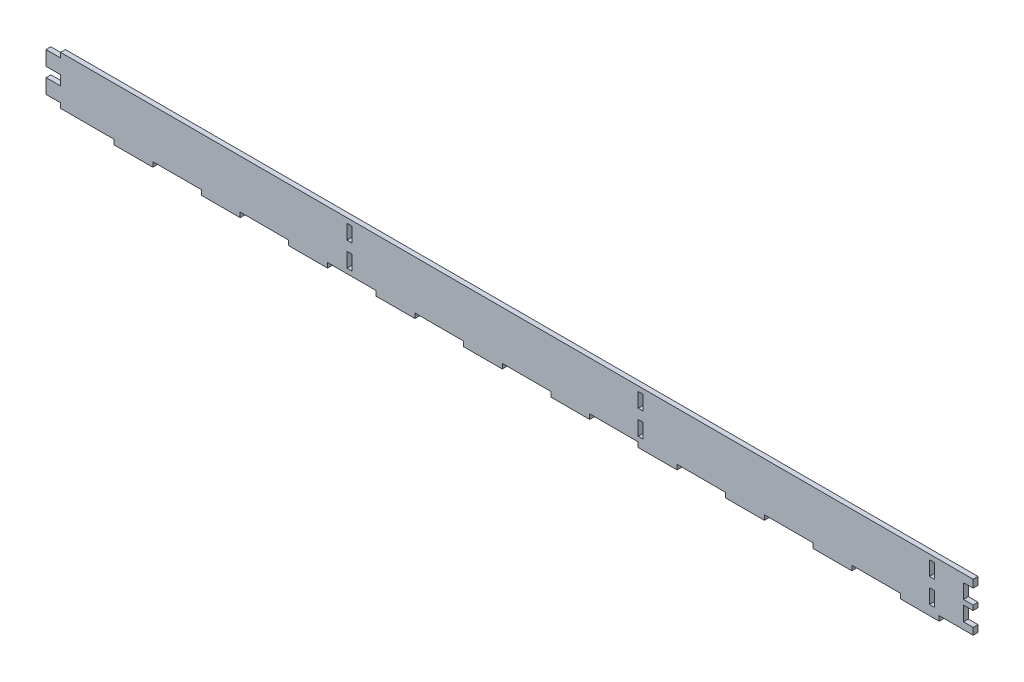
ISO-10303-21;
HEADER;
FILE_DESCRIPTION(('STEP AP214'),'2;1');
FILE_NAME('part.step','',(''),(''),'','','');
FILE_SCHEMA(('AUTOMOTIVE_DESIGN { 1 0 10303 214 1 1 1 1 }'));
ENDSEC;
DATA;
#1=APPLICATION_CONTEXT('core data for automotive mechanical design processes');
#2=APPLICATION_PROTOCOL_DEFINITION('international standard','automotive_design',2000,#1);
#3=PRODUCT_CONTEXT('',#1,'mechanical');
#4=PRODUCT('Part','Part','',(#3));
#5=PRODUCT_RELATED_PRODUCT_CATEGORY('part','',(#4));
#6=PRODUCT_DEFINITION_FORMATION('','',#4);
#7=PRODUCT_DEFINITION_CONTEXT('part definition',#1,'design');
#8=PRODUCT_DEFINITION('design','',#6,#7);
#9=PRODUCT_DEFINITION_SHAPE('','',#8);
#10=(LENGTH_UNIT() NAMED_UNIT(*) SI_UNIT(.MILLI.,.METRE.));
#11=(NAMED_UNIT(*) PLANE_ANGLE_UNIT() SI_UNIT($,.RADIAN.));
#12=(NAMED_UNIT(*) SI_UNIT($,.STERADIAN.) SOLID_ANGLE_UNIT());
#13=UNCERTAINTY_MEASURE_WITH_UNIT(LENGTH_MEASURE(1.E-05),#10,'distance_accuracy_value','');
#14=(GEOMETRIC_REPRESENTATION_CONTEXT(3) GLOBAL_UNCERTAINTY_ASSIGNED_CONTEXT((#13)) GLOBAL_UNIT_ASSIGNED_CONTEXT((#10,
#11,#12)) REPRESENTATION_CONTEXT('',''));
#15=CARTESIAN_POINT('',(0.,0.,0.));
#16=DIRECTION('',(0.,0.,1.));
#17=DIRECTION('',(1.,0.,0.));
#18=AXIS2_PLACEMENT_3D('',#15,#16,#17);
#19=CARTESIAN_POINT('',(0.,0.,5.));
#20=DIRECTION('',(0.,0.,1.));
#21=DIRECTION('',(1.,0.,0.));
#22=AXIS2_PLACEMENT_3D('',#19,#20,#21);
#23=PLANE('',#22);
#24=DIRECTION('',(0.,-1.,0.));
#25=VECTOR('',#24,1.);
#26=CARTESIAN_POINT('',(55.,7.00000000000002,5.));
#27=LINE('',#26,#25);
#28=CARTESIAN_POINT('',(55.,7.00000000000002,5.));
#29=VERTEX_POINT('',#28);
#30=CARTESIAN_POINT('',(55.,0.,5.));
#31=VERTEX_POINT('',#30);
#32=EDGE_CURVE('E585',#29,#31,#27,.T.);
#33=ORIENTED_EDGE('',*,*,#32,.F.);
#34=DIRECTION('',(1.,0.,0.));
#35=VECTOR('',#34,1.);
#36=CARTESIAN_POINT('',(45.,7.00000000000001,5.));
#37=LINE('',#36,#35);
#38=CARTESIAN_POINT('',(45.,7.00000000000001,5.));
#39=VERTEX_POINT('',#38);
#40=EDGE_CURVE('E587',#39,#29,#37,.T.);
#41=ORIENTED_EDGE('',*,*,#40,.F.);
#42=DIRECTION('',(0.,-1.,0.));
#43=VECTOR('',#42,1.);
#44=CARTESIAN_POINT('',(45.,22.,5.));
#45=LINE('',#44,#43);
#46=CARTESIAN_POINT('',(45.,22.,5.));
#47=VERTEX_POINT('',#46);
#48=EDGE_CURVE('E623',#47,#39,#45,.T.);
#49=ORIENTED_EDGE('',*,*,#48,.F.);
#50=DIRECTION('',(-1.,0.,0.));
#51=VECTOR('',#50,1.);
#52=CARTESIAN_POINT('',(55.,22.,5.));
#53=LINE('',#52,#51);
#54=CARTESIAN_POINT('',(55.,22.,5.));
#55=VERTEX_POINT('',#54);
#56=EDGE_CURVE('E620',#55,#47,#53,.T.);
#57=ORIENTED_EDGE('',*,*,#56,.F.);
#58=DIRECTION('',(0.,-1.,0.));
#59=VECTOR('',#58,1.);
#60=CARTESIAN_POINT('',(55.,27.,5.));
#61=LINE('',#60,#59);
#62=CARTESIAN_POINT('',(55.,27.,5.));
#63=VERTEX_POINT('',#62);
#64=EDGE_CURVE('E617',#63,#55,#61,.T.);
#65=ORIENTED_EDGE('',*,*,#64,.F.);
#66=DIRECTION('',(1.,0.,0.));
#67=VECTOR('',#66,1.);
#68=CARTESIAN_POINT('',(45.,27.,5.));
#69=LINE('',#68,#67);
#70=CARTESIAN_POINT('',(45.,27.,5.));
#71=VERTEX_POINT('',#70);
#72=EDGE_CURVE('E614',#71,#63,#69,.T.);
#73=ORIENTED_EDGE('',*,*,#72,.F.);
#74=DIRECTION('',(0.,-1.,0.));
#75=VECTOR('',#74,1.);
#76=CARTESIAN_POINT('',(45.,42.,5.));
#77=LINE('',#76,#75);
#78=CARTESIAN_POINT('',(45.,42.,5.));
#79=VERTEX_POINT('',#78);
#80=EDGE_CURVE('E611',#79,#71,#77,.T.);
#81=ORIENTED_EDGE('',*,*,#80,.F.);
#82=DIRECTION('',(-1.,0.,0.));
#83=VECTOR('',#82,1.);
#84=CARTESIAN_POINT('',(55.,42.,5.));
#85=LINE('',#84,#83);
#86=CARTESIAN_POINT('',(55.,42.,5.));
#87=VERTEX_POINT('',#86);
#88=EDGE_CURVE('E609',#87,#79,#85,.T.);
#89=ORIENTED_EDGE('',*,*,#88,.F.);
#90=DIRECTION('',(0.,-1.,0.));
#91=VECTOR('',#90,1.);
#92=CARTESIAN_POINT('',(55.,50.,5.));
#93=LINE('',#92,#91);
#94=CARTESIAN_POINT('',(55.,50.,5.));
#95=VERTEX_POINT('',#94);
#96=EDGE_CURVE('E564',#95,#87,#93,.T.);
#97=ORIENTED_EDGE('',*,*,#96,.F.);
#98=DIRECTION('',(-1.,0.,0.));
#99=VECTOR('',#98,1.);
#100=CARTESIAN_POINT('',(885.,50.,5.));
#101=LINE('',#100,#99);
#102=CARTESIAN_POINT('',(-885.,50.,5.));
#103=VERTEX_POINT('',#102);
#104=EDGE_CURVE('E917',#95,#103,#101,.T.);
#105=ORIENTED_EDGE('',*,*,#104,.T.);
#106=DIRECTION('',(0.,-1.,0.));
#107=VECTOR('',#106,1.);
#108=CARTESIAN_POINT('',(-885.,50.,5.));
#109=LINE('',#108,#107);
#110=CARTESIAN_POINT('',(-885.,45.,5.));
#111=VERTEX_POINT('',#110);
#112=EDGE_CURVE('E919',#103,#111,#109,.T.);
#113=ORIENTED_EDGE('',*,*,#112,.T.);
#114=DIRECTION('',(-1.,0.,0.));
#115=VECTOR('',#114,1.);
#116=CARTESIAN_POINT('',(-885.,45.,5.));
#117=LINE('',#116,#115);
#118=CARTESIAN_POINT('',(-900.,45.,5.));
#119=VERTEX_POINT('',#118);
#120=EDGE_CURVE('E921',#111,#119,#117,.T.);
#121=ORIENTED_EDGE('',*,*,#120,.T.);
#122=DIRECTION('',(0.,-1.,0.));
#123=VECTOR('',#122,1.);
#124=CARTESIAN_POINT('',(-900.,45.,5.));
#125=LINE('',#124,#123);
#126=CARTESIAN_POINT('',(-900.,30.,5.));
#127=VERTEX_POINT('',#126);
#128=EDGE_CURVE('E923',#119,#127,#125,.T.);
#129=ORIENTED_EDGE('',*,*,#128,.T.);
#130=DIRECTION('',(1.,0.,0.));
#131=VECTOR('',#130,1.);
#132=CARTESIAN_POINT('',(-900.,30.,5.));
#133=LINE('',#132,#131);
#134=CARTESIAN_POINT('',(-885.,30.,5.));
#135=VERTEX_POINT('',#134);
#136=EDGE_CURVE('E925',#127,#135,#133,.T.);
#137=ORIENTED_EDGE('',*,*,#136,.T.);
#138=DIRECTION('',(0.,-1.,0.));
#139=VECTOR('',#138,1.);
#140=CARTESIAN_POINT('',(-885.,30.,5.));
#141=LINE('',#140,#139);
#142=CARTESIAN_POINT('',(-885.,20.,5.));
#143=VERTEX_POINT('',#142);
#144=EDGE_CURVE('E927',#135,#143,#141,.T.);
#145=ORIENTED_EDGE('',*,*,#144,.T.);
#146=DIRECTION('',(-1.,0.,0.));
#147=VECTOR('',#146,1.);
#148=CARTESIAN_POINT('',(-885.,20.,5.));
#149=LINE('',#148,#147);
#150=CARTESIAN_POINT('',(-900.,20.,5.));
#151=VERTEX_POINT('',#150);
#152=EDGE_CURVE('E929',#143,#151,#149,.T.);
#153=ORIENTED_EDGE('',*,*,#152,.T.);
#154=DIRECTION('',(0.,-1.,0.));
#155=VECTOR('',#154,1.);
#156=CARTESIAN_POINT('',(-900.,20.,5.));
#157=LINE('',#156,#155);
#158=CARTESIAN_POINT('',(-900.,5.,5.));
#159=VERTEX_POINT('',#158);
#160=EDGE_CURVE('E931',#151,#159,#157,.T.);
#161=ORIENTED_EDGE('',*,*,#160,.T.);
#162=DIRECTION('',(1.,0.,0.));
#163=VECTOR('',#162,1.);
#164=CARTESIAN_POINT('',(-900.,5.,5.));
#165=LINE('',#164,#163);
#166=CARTESIAN_POINT('',(-885.,5.,5.));
#167=VERTEX_POINT('',#166);
#168=EDGE_CURVE('E933',#159,#167,#165,.T.);
#169=ORIENTED_EDGE('',*,*,#168,.T.);
#170=DIRECTION('',(0.,-1.,0.));
#171=VECTOR('',#170,1.);
#172=CARTESIAN_POINT('',(-885.,5.,5.));
#173=LINE('',#172,#171);
#174=CARTESIAN_POINT('',(-885.,0.,5.));
#175=VERTEX_POINT('',#174);
#176=EDGE_CURVE('E830',#167,#175,#173,.T.);
#177=ORIENTED_EDGE('',*,*,#176,.T.);
#178=DIRECTION('',(1.,0.,0.));
#179=VECTOR('',#178,1.);
#180=CARTESIAN_POINT('',(-885.,0.,5.));
#181=LINE('',#180,#179);
#182=CARTESIAN_POINT('',(-830.,0.,5.));
#183=VERTEX_POINT('',#182);
#184=EDGE_CURVE('E833',#175,#183,#181,.T.);
#185=ORIENTED_EDGE('',*,*,#184,.T.);
#186=DIRECTION('',(0.,-1.,0.));
#187=VECTOR('',#186,1.);
#188=CARTESIAN_POINT('',(-830.,0.,5.));
#189=LINE('',#188,#187);
#190=CARTESIAN_POINT('',(-830.,-5.,5.));
#191=VERTEX_POINT('',#190);
#192=EDGE_CURVE('E836',#183,#191,#189,.T.);
#193=ORIENTED_EDGE('',*,*,#192,.T.);
#194=DIRECTION('',(1.,0.,0.));
#195=VECTOR('',#194,1.);
#196=CARTESIAN_POINT('',(-830.,-5.,5.));
#197=LINE('',#196,#195);
#198=CARTESIAN_POINT('',(-790.,-5.,5.));
#199=VERTEX_POINT('',#198);
#200=EDGE_CURVE('E838',#191,#199,#197,.T.);
#201=ORIENTED_EDGE('',*,*,#200,.T.);
#202=DIRECTION('',(0.,1.,0.));
#203=VECTOR('',#202,1.);
#204=CARTESIAN_POINT('',(-790.,-5.,5.));
#205=LINE('',#204,#203);
#206=CARTESIAN_POINT('',(-790.,0.,5.));
#207=VERTEX_POINT('',#206);
#208=EDGE_CURVE('E840',#199,#207,#205,.T.);
#209=ORIENTED_EDGE('',*,*,#208,.T.);
#210=DIRECTION('',(1.,0.,0.));
#211=VECTOR('',#210,1.);
#212=CARTESIAN_POINT('',(-790.,0.,5.));
#213=LINE('',#212,#211);
#214=CARTESIAN_POINT('',(-740.,0.,5.));
#215=VERTEX_POINT('',#214);
#216=EDGE_CURVE('E842',#207,#215,#213,.T.);
#217=ORIENTED_EDGE('',*,*,#216,.T.);
#218=DIRECTION('',(0.,-1.,0.));
#219=VECTOR('',#218,1.);
#220=CARTESIAN_POINT('',(-740.,0.,5.));
#221=LINE('',#220,#219);
#222=CARTESIAN_POINT('',(-740.,-5.,5.));
#223=VERTEX_POINT('',#222);
#224=EDGE_CURVE('E844',#215,#223,#221,.T.);
#225=ORIENTED_EDGE('',*,*,#224,.T.);
#226=DIRECTION('',(1.,0.,0.));
#227=VECTOR('',#226,1.);
#228=CARTESIAN_POINT('',(-740.,-5.,5.));
#229=LINE('',#228,#227);
#230=CARTESIAN_POINT('',(-700.,-5.,5.));
#231=VERTEX_POINT('',#230);
#232=EDGE_CURVE('E846',#223,#231,#229,.T.);
#233=ORIENTED_EDGE('',*,*,#232,.T.);
#234=DIRECTION('',(0.,1.,0.));
#235=VECTOR('',#234,1.);
#236=CARTESIAN_POINT('',(-700.,-5.,5.));
#237=LINE('',#236,#235);
#238=CARTESIAN_POINT('',(-700.,0.,5.));
#239=VERTEX_POINT('',#238);
#240=EDGE_CURVE('E848',#231,#239,#237,.T.);
#241=ORIENTED_EDGE('',*,*,#240,.T.);
#242=DIRECTION('',(1.,0.,0.));
#243=VECTOR('',#242,1.);
#244=CARTESIAN_POINT('',(-700.,0.,5.));
#245=LINE('',#244,#243);
#246=CARTESIAN_POINT('',(-650.,0.,5.));
#247=VERTEX_POINT('',#246);
#248=EDGE_CURVE('E850',#239,#247,#245,.T.);
#249=ORIENTED_EDGE('',*,*,#248,.T.);
#250=DIRECTION('',(0.,-1.,0.));
#251=VECTOR('',#250,1.);
#252=CARTESIAN_POINT('',(-650.,0.,5.));
#253=LINE('',#252,#251);
#254=CARTESIAN_POINT('',(-650.,-5.,5.));
#255=VERTEX_POINT('',#254);
#256=EDGE_CURVE('E852',#247,#255,#253,.T.);
#257=ORIENTED_EDGE('',*,*,#256,.T.);
#258=DIRECTION('',(1.,0.,0.));
#259=VECTOR('',#258,1.);
#260=CARTESIAN_POINT('',(-650.,-5.,5.));
#261=LINE('',#260,#259);
#262=CARTESIAN_POINT('',(-610.,-5.,5.));
#263=VERTEX_POINT('',#262);
#264=EDGE_CURVE('E854',#255,#263,#261,.T.);
#265=ORIENTED_EDGE('',*,*,#264,.T.);
#266=DIRECTION('',(0.,1.,0.));
#267=VECTOR('',#266,1.);
#268=CARTESIAN_POINT('',(-610.,-5.,5.));
#269=LINE('',#268,#267);
#270=CARTESIAN_POINT('',(-610.,0.,5.));
#271=VERTEX_POINT('',#270);
#272=EDGE_CURVE('E856',#263,#271,#269,.T.);
#273=ORIENTED_EDGE('',*,*,#272,.T.);
#274=DIRECTION('',(1.,0.,0.));
#275=VECTOR('',#274,1.);
#276=CARTESIAN_POINT('',(-610.,0.,5.));
#277=LINE('',#276,#275);
#278=CARTESIAN_POINT('',(-560.,0.,5.));
#279=VERTEX_POINT('',#278);
#280=EDGE_CURVE('E858',#271,#279,#277,.T.);
#281=ORIENTED_EDGE('',*,*,#280,.T.);
#282=DIRECTION('',(0.,-1.,0.));
#283=VECTOR('',#282,1.);
#284=CARTESIAN_POINT('',(-560.,0.,5.));
#285=LINE('',#284,#283);
#286=CARTESIAN_POINT('',(-560.,-5.,5.));
#287=VERTEX_POINT('',#286);
#288=EDGE_CURVE('E860',#279,#287,#285,.T.);
#289=ORIENTED_EDGE('',*,*,#288,.T.);
#290=DIRECTION('',(1.,0.,0.));
#291=VECTOR('',#290,1.);
#292=CARTESIAN_POINT('',(-560.,-5.,5.));
#293=LINE('',#292,#291);
#294=CARTESIAN_POINT('',(-520.,-5.,5.));
#295=VERTEX_POINT('',#294);
#296=EDGE_CURVE('E862',#287,#295,#293,.T.);
#297=ORIENTED_EDGE('',*,*,#296,.T.);
#298=DIRECTION('',(0.,1.,0.));
#299=VECTOR('',#298,1.);
#300=CARTESIAN_POINT('',(-520.,-5.,5.));
#301=LINE('',#300,#299);
#302=CARTESIAN_POINT('',(-520.,0.,5.));
#303=VERTEX_POINT('',#302);
#304=EDGE_CURVE('E864',#295,#303,#301,.T.);
#305=ORIENTED_EDGE('',*,*,#304,.T.);
#306=DIRECTION('',(1.,0.,0.));
#307=VECTOR('',#306,1.);
#308=CARTESIAN_POINT('',(-520.,0.,5.));
#309=LINE('',#308,#307);
#310=CARTESIAN_POINT('',(-470.,0.,5.));
#311=VERTEX_POINT('',#310);
#312=EDGE_CURVE('E866',#303,#311,#309,.T.);
#313=ORIENTED_EDGE('',*,*,#312,.T.);
#314=DIRECTION('',(0.,-1.,0.));
#315=VECTOR('',#314,1.);
#316=CARTESIAN_POINT('',(-470.,0.,5.));
#317=LINE('',#316,#315);
#318=CARTESIAN_POINT('',(-470.,-5.,5.));
#319=VERTEX_POINT('',#318);
#320=EDGE_CURVE('E868',#311,#319,#317,.T.);
#321=ORIENTED_EDGE('',*,*,#320,.T.);
#322=DIRECTION('',(1.,0.,0.));
#323=VECTOR('',#322,1.);
#324=CARTESIAN_POINT('',(-470.,-5.,5.));
#325=LINE('',#324,#323);
#326=CARTESIAN_POINT('',(-430.,-5.,5.));
#327=VERTEX_POINT('',#326);
#328=EDGE_CURVE('E870',#319,#327,#325,.T.);
#329=ORIENTED_EDGE('',*,*,#328,.T.);
#330=DIRECTION('',(0.,1.,0.));
#331=VECTOR('',#330,1.);
#332=CARTESIAN_POINT('',(-430.,-5.,5.));
#333=LINE('',#332,#331);
#334=CARTESIAN_POINT('',(-430.,0.,5.));
#335=VERTEX_POINT('',#334);
#336=EDGE_CURVE('E872',#327,#335,#333,.T.);
#337=ORIENTED_EDGE('',*,*,#336,.T.);
#338=DIRECTION('',(1.,0.,0.));
#339=VECTOR('',#338,1.);
#340=CARTESIAN_POINT('',(-430.,0.,5.));
#341=LINE('',#340,#339);
#342=CARTESIAN_POINT('',(-380.,0.,5.));
#343=VERTEX_POINT('',#342);
#344=EDGE_CURVE('E874',#335,#343,#341,.T.);
#345=ORIENTED_EDGE('',*,*,#344,.T.);
#346=DIRECTION('',(0.,-1.,0.));
#347=VECTOR('',#346,1.);
#348=CARTESIAN_POINT('',(-380.,0.,5.));
#349=LINE('',#348,#347);
#350=CARTESIAN_POINT('',(-380.,-5.,5.));
#351=VERTEX_POINT('',#350);
#352=EDGE_CURVE('E876',#343,#351,#349,.T.);
#353=ORIENTED_EDGE('',*,*,#352,.T.);
#354=DIRECTION('',(1.,0.,0.));
#355=VECTOR('',#354,1.);
#356=CARTESIAN_POINT('',(-380.,-5.,5.));
#357=LINE('',#356,#355);
#358=CARTESIAN_POINT('',(-340.,-5.,5.));
#359=VERTEX_POINT('',#358);
#360=EDGE_CURVE('E878',#351,#359,#357,.T.);
#361=ORIENTED_EDGE('',*,*,#360,.T.);
#362=DIRECTION('',(0.,1.,0.));
#363=VECTOR('',#362,1.);
#364=CARTESIAN_POINT('',(-340.,-5.,5.));
#365=LINE('',#364,#363);
#366=CARTESIAN_POINT('',(-340.,0.,5.));
#367=VERTEX_POINT('',#366);
#368=EDGE_CURVE('E880',#359,#367,#365,.T.);
#369=ORIENTED_EDGE('',*,*,#368,.T.);
#370=DIRECTION('',(1.,0.,0.));
#371=VECTOR('',#370,1.);
#372=CARTESIAN_POINT('',(-340.,0.,5.));
#373=LINE('',#372,#371);
#374=CARTESIAN_POINT('',(-290.,0.,5.));
#375=VERTEX_POINT('',#374);
#376=EDGE_CURVE('E882',#367,#375,#373,.T.);
#377=ORIENTED_EDGE('',*,*,#376,.T.);
#378=DIRECTION('',(0.,-1.,0.));
#379=VECTOR('',#378,1.);
#380=CARTESIAN_POINT('',(-290.,0.,5.));
#381=LINE('',#380,#379);
#382=CARTESIAN_POINT('',(-290.,-5.,5.));
#383=VERTEX_POINT('',#382);
#384=EDGE_CURVE('E884',#375,#383,#381,.T.);
#385=ORIENTED_EDGE('',*,*,#384,.T.);
#386=DIRECTION('',(1.,0.,0.));
#387=VECTOR('',#386,1.);
#388=CARTESIAN_POINT('',(-290.,-5.,5.));
#389=LINE('',#388,#387);
#390=CARTESIAN_POINT('',(-250.,-5.,5.));
#391=VERTEX_POINT('',#390);
#392=EDGE_CURVE('E886',#383,#391,#389,.T.);
#393=ORIENTED_EDGE('',*,*,#392,.T.);
#394=DIRECTION('',(0.,1.,0.));
#395=VECTOR('',#394,1.);
#396=CARTESIAN_POINT('',(-250.,-5.,5.));
#397=LINE('',#396,#395);
#398=CARTESIAN_POINT('',(-250.,0.,5.));
#399=VERTEX_POINT('',#398);
#400=EDGE_CURVE('E888',#391,#399,#397,.T.);
#401=ORIENTED_EDGE('',*,*,#400,.T.);
#402=DIRECTION('',(1.,0.,0.));
#403=VECTOR('',#402,1.);
#404=CARTESIAN_POINT('',(-250.,0.,5.));
#405=LINE('',#404,#403);
#406=CARTESIAN_POINT('',(-200.,0.,5.));
#407=VERTEX_POINT('',#406);
#408=EDGE_CURVE('E890',#399,#407,#405,.T.);
#409=ORIENTED_EDGE('',*,*,#408,.T.);
#410=DIRECTION('',(0.,-1.,0.));
#411=VECTOR('',#410,1.);
#412=CARTESIAN_POINT('',(-200.,0.,5.));
#413=LINE('',#412,#411);
#414=CARTESIAN_POINT('',(-200.,-5.,5.));
#415=VERTEX_POINT('',#414);
#416=EDGE_CURVE('E892',#407,#415,#413,.T.);
#417=ORIENTED_EDGE('',*,*,#416,.T.);
#418=DIRECTION('',(1.,0.,0.));
#419=VECTOR('',#418,1.);
#420=CARTESIAN_POINT('',(-200.,-5.,5.));
#421=LINE('',#420,#419);
#422=CARTESIAN_POINT('',(-160.,-5.,5.));
#423=VERTEX_POINT('',#422);
#424=EDGE_CURVE('E894',#415,#423,#421,.T.);
#425=ORIENTED_EDGE('',*,*,#424,.T.);
#426=DIRECTION('',(0.,1.,0.));
#427=VECTOR('',#426,1.);
#428=CARTESIAN_POINT('',(-160.,-5.,5.));
#429=LINE('',#428,#427);
#430=CARTESIAN_POINT('',(-160.,0.,5.));
#431=VERTEX_POINT('',#430);
#432=EDGE_CURVE('E896',#423,#431,#429,.T.);
#433=ORIENTED_EDGE('',*,*,#432,.T.);
#434=DIRECTION('',(1.,0.,0.));
#435=VECTOR('',#434,1.);
#436=CARTESIAN_POINT('',(-160.,0.,5.));
#437=LINE('',#436,#435);
#438=CARTESIAN_POINT('',(-110.,0.,5.));
#439=VERTEX_POINT('',#438);
#440=EDGE_CURVE('E898',#431,#439,#437,.T.);
#441=ORIENTED_EDGE('',*,*,#440,.T.);
#442=DIRECTION('',(0.,-1.,0.));
#443=VECTOR('',#442,1.);
#444=CARTESIAN_POINT('',(-110.,0.,5.));
#445=LINE('',#444,#443);
#446=CARTESIAN_POINT('',(-110.,-5.,5.));
#447=VERTEX_POINT('',#446);
#448=EDGE_CURVE('E900',#439,#447,#445,.T.);
#449=ORIENTED_EDGE('',*,*,#448,.T.);
#450=DIRECTION('',(1.,0.,0.));
#451=VECTOR('',#450,1.);
#452=CARTESIAN_POINT('',(-110.,-5.,5.));
#453=LINE('',#452,#451);
#454=CARTESIAN_POINT('',(-70.,-5.,5.));
#455=VERTEX_POINT('',#454);
#456=EDGE_CURVE('E902',#447,#455,#453,.T.);
#457=ORIENTED_EDGE('',*,*,#456,.T.);
#458=DIRECTION('',(0.,1.,0.));
#459=VECTOR('',#458,1.);
#460=CARTESIAN_POINT('',(-70.,-5.,5.));
#461=LINE('',#460,#459);
#462=CARTESIAN_POINT('',(-70.,0.,5.));
#463=VERTEX_POINT('',#462);
#464=EDGE_CURVE('E904',#455,#463,#461,.T.);
#465=ORIENTED_EDGE('',*,*,#464,.T.);
#466=DIRECTION('',(1.,0.,0.));
#467=VECTOR('',#466,1.);
#468=CARTESIAN_POINT('',(-70.,0.,5.));
#469=LINE('',#468,#467);
#470=CARTESIAN_POINT('',(-20.,0.,5.));
#471=VERTEX_POINT('',#470);
#472=EDGE_CURVE('E906',#463,#471,#469,.T.);
#473=ORIENTED_EDGE('',*,*,#472,.T.);
#474=DIRECTION('',(0.,-1.,0.));
#475=VECTOR('',#474,1.);
#476=CARTESIAN_POINT('',(-20.,0.,5.));
#477=LINE('',#476,#475);
#478=CARTESIAN_POINT('',(-20.,-5.,5.));
#479=VERTEX_POINT('',#478);
#480=EDGE_CURVE('E908',#471,#479,#477,.T.);
#481=ORIENTED_EDGE('',*,*,#480,.T.);
#482=DIRECTION('',(1.,0.,0.));
#483=VECTOR('',#482,1.);
#484=CARTESIAN_POINT('',(-20.,-5.,5.));
#485=LINE('',#484,#483);
#486=CARTESIAN_POINT('',(20.,-5.,5.));
#487=VERTEX_POINT('',#486);
#488=EDGE_CURVE('E910',#479,#487,#485,.T.);
#489=ORIENTED_EDGE('',*,*,#488,.T.);
#490=DIRECTION('',(0.,1.,0.));
#491=VECTOR('',#490,1.);
#492=CARTESIAN_POINT('',(20.,-5.,5.));
#493=LINE('',#492,#491);
#494=CARTESIAN_POINT('',(20.,0.,5.));
#495=VERTEX_POINT('',#494);
#496=EDGE_CURVE('E912',#487,#495,#493,.T.);
#497=ORIENTED_EDGE('',*,*,#496,.T.);
#498=DIRECTION('',(1.,0.,0.));
#499=VECTOR('',#498,1.);
#500=CARTESIAN_POINT('',(20.,0.,5.));
#501=LINE('',#500,#499);
#502=EDGE_CURVE('E914',#495,#31,#501,.T.);
#503=ORIENTED_EDGE('',*,*,#502,.T.);
#504=EDGE_LOOP('',(#33,#41,#49,#57,#65,#73,#81,#89,#97,#105,#113,#121,#129,#137,#145,#153,#161,
#169,#177,#185,#193,#201,#209,#217,#225,#233,#241,#249,#257,#265,#273,#281,#289,#297,#305,#313,
#321,#329,#337,#345,#353,#361,#369,#377,#385,#393,#401,#409,#417,#425,#433,#441,#449,#457,#465,
#473,#481,#489,#497,#503));
#505=FACE_BOUND('',#504,.T.);
#506=DIRECTION('',(0.,-1.,0.));
#507=VECTOR('',#506,1.);
#508=CARTESIAN_POINT('',(-590.,20.,5.));
#509=LINE('',#508,#507);
#510=CARTESIAN_POINT('',(-590.,20.,5.));
#511=VERTEX_POINT('',#510);
#512=CARTESIAN_POINT('',(-590.,5.,5.));
#513=VERTEX_POINT('',#512);
#514=EDGE_CURVE('E801',#511,#513,#509,.T.);
#515=ORIENTED_EDGE('',*,*,#514,.F.);
#516=DIRECTION('',(-1.,0.,0.));
#517=VECTOR('',#516,1.);
#518=CARTESIAN_POINT('',(-585.,20.,5.));
#519=LINE('',#518,#517);
#520=CARTESIAN_POINT('',(-585.,20.,5.));
#521=VERTEX_POINT('',#520);
#522=EDGE_CURVE('E799',#521,#511,#519,.T.);
#523=ORIENTED_EDGE('',*,*,#522,.F.);
#524=DIRECTION('',(0.,1.,0.));
#525=VECTOR('',#524,1.);
#526=CARTESIAN_POINT('',(-585.,5.,5.));
#527=LINE('',#526,#525);
#528=CARTESIAN_POINT('',(-585.,5.,5.));
#529=VERTEX_POINT('',#528);
#530=EDGE_CURVE('E807',#529,#521,#527,.T.);
#531=ORIENTED_EDGE('',*,*,#530,.F.);
#532=DIRECTION('',(1.,0.,0.));
#533=VECTOR('',#532,1.);
#534=CARTESIAN_POINT('',(-590.,5.,5.));
#535=LINE('',#534,#533);
#536=EDGE_CURVE('E804',#513,#529,#535,.T.);
#537=ORIENTED_EDGE('',*,*,#536,.F.);
#538=EDGE_LOOP('',(#515,#523,#531,#537));
#539=FACE_BOUND('',#538,.T.);
#540=DIRECTION('',(0.,-1.,0.));
#541=VECTOR('',#540,1.);
#542=CARTESIAN_POINT('',(-590.,45.,5.));
#543=LINE('',#542,#541);
#544=CARTESIAN_POINT('',(-590.,45.,5.));
#545=VERTEX_POINT('',#544);
#546=CARTESIAN_POINT('',(-590.,30.,5.));
#547=VERTEX_POINT('',#546);
#548=EDGE_CURVE('E770',#545,#547,#543,.T.);
#549=ORIENTED_EDGE('',*,*,#548,.F.);
#550=DIRECTION('',(-1.,0.,0.));
#551=VECTOR('',#550,1.);
#552=CARTESIAN_POINT('',(-585.,45.,5.));
#553=LINE('',#552,#551);
#554=CARTESIAN_POINT('',(-585.,45.,5.));
#555=VERTEX_POINT('',#554);
#556=EDGE_CURVE('E768',#555,#545,#553,.T.);
#557=ORIENTED_EDGE('',*,*,#556,.F.);
#558=DIRECTION('',(0.,1.,0.));
#559=VECTOR('',#558,1.);
#560=CARTESIAN_POINT('',(-585.,30.,5.));
#561=LINE('',#560,#559);
#562=CARTESIAN_POINT('',(-585.,30.,5.));
#563=VERTEX_POINT('',#562);
#564=EDGE_CURVE('E776',#563,#555,#561,.T.);
#565=ORIENTED_EDGE('',*,*,#564,.F.);
#566=DIRECTION('',(1.,0.,0.));
#567=VECTOR('',#566,1.);
#568=CARTESIAN_POINT('',(-590.,30.,5.));
#569=LINE('',#568,#567);
#570=EDGE_CURVE('E773',#547,#563,#569,.T.);
#571=ORIENTED_EDGE('',*,*,#570,.F.);
#572=EDGE_LOOP('',(#549,#557,#565,#571));
#573=FACE_BOUND('',#572,.T.);
#574=DIRECTION('',(0.,-1.,0.));
#575=VECTOR('',#574,1.);
#576=CARTESIAN_POINT('',(10.,20.,5.));
#577=LINE('',#576,#575);
#578=CARTESIAN_POINT('',(10.,20.,5.));
#579=VERTEX_POINT('',#578);
#580=CARTESIAN_POINT('',(10.,5.,5.));
#581=VERTEX_POINT('',#580);
#582=EDGE_CURVE('E739',#579,#581,#577,.T.);
#583=ORIENTED_EDGE('',*,*,#582,.F.);
#584=DIRECTION('',(-1.,0.,0.));
#585=VECTOR('',#584,1.);
#586=CARTESIAN_POINT('',(15.,20.,5.));
#587=LINE('',#586,#585);
#588=CARTESIAN_POINT('',(15.,20.,5.));
#589=VERTEX_POINT('',#588);
#590=EDGE_CURVE('E737',#589,#579,#587,.T.);
#591=ORIENTED_EDGE('',*,*,#590,.F.);
#592=DIRECTION('',(0.,1.,0.));
#593=VECTOR('',#592,1.);
#594=CARTESIAN_POINT('',(15.,5.,5.));
#595=LINE('',#594,#593);
#596=CARTESIAN_POINT('',(15.,5.,5.));
#597=VERTEX_POINT('',#596);
#598=EDGE_CURVE('E745',#597,#589,#595,.T.);
#599=ORIENTED_EDGE('',*,*,#598,.F.);
#600=DIRECTION('',(1.,0.,0.));
#601=VECTOR('',#600,1.);
#602=CARTESIAN_POINT('',(10.,5.,5.));
#603=LINE('',#602,#601);
#604=EDGE_CURVE('E742',#581,#597,#603,.T.);
#605=ORIENTED_EDGE('',*,*,#604,.F.);
#606=EDGE_LOOP('',(#583,#591,#599,#605));
#607=FACE_BOUND('',#606,.T.);
#608=DIRECTION('',(0.,-1.,0.));
#609=VECTOR('',#608,1.);
#610=CARTESIAN_POINT('',(10.,45.,5.));
#611=LINE('',#610,#609);
#612=CARTESIAN_POINT('',(10.,45.,5.));
#613=VERTEX_POINT('',#612);
#614=CARTESIAN_POINT('',(10.,30.,5.));
#615=VERTEX_POINT('',#614);
#616=EDGE_CURVE('E708',#613,#615,#611,.T.);
#617=ORIENTED_EDGE('',*,*,#616,.F.);
#618=DIRECTION('',(-1.,0.,0.));
#619=VECTOR('',#618,1.);
#620=CARTESIAN_POINT('',(15.,45.,5.));
#621=LINE('',#620,#619);
#622=CARTESIAN_POINT('',(15.,45.,5.));
#623=VERTEX_POINT('',#622);
#624=EDGE_CURVE('E706',#623,#613,#621,.T.);
#625=ORIENTED_EDGE('',*,*,#624,.F.);
#626=DIRECTION('',(0.,1.,0.));
#627=VECTOR('',#626,1.);
#628=CARTESIAN_POINT('',(15.,30.,5.));
#629=LINE('',#628,#627);
#630=CARTESIAN_POINT('',(15.,30.,5.));
#631=VERTEX_POINT('',#630);
#632=EDGE_CURVE('E714',#631,#623,#629,.T.);
#633=ORIENTED_EDGE('',*,*,#632,.F.);
#634=DIRECTION('',(1.,0.,0.));
#635=VECTOR('',#634,1.);
#636=CARTESIAN_POINT('',(10.,30.,5.));
#637=LINE('',#636,#635);
#638=EDGE_CURVE('E711',#615,#631,#637,.T.);
#639=ORIENTED_EDGE('',*,*,#638,.F.);
#640=EDGE_LOOP('',(#617,#625,#633,#639));
#641=FACE_BOUND('',#640,.T.);
#642=DIRECTION('',(0.,-1.,0.));
#643=VECTOR('',#642,1.);
#644=CARTESIAN_POINT('',(-290.,20.,5.));
#645=LINE('',#644,#643);
#646=CARTESIAN_POINT('',(-290.,20.,5.));
#647=VERTEX_POINT('',#646);
#648=CARTESIAN_POINT('',(-290.,5.,5.));
#649=VERTEX_POINT('',#648);
#650=EDGE_CURVE('E677',#647,#649,#645,.T.);
#651=ORIENTED_EDGE('',*,*,#650,.F.);
#652=DIRECTION('',(-1.,0.,0.));
#653=VECTOR('',#652,1.);
#654=CARTESIAN_POINT('',(-285.,20.,5.));
#655=LINE('',#654,#653);
#656=CARTESIAN_POINT('',(-285.,20.,5.));
#657=VERTEX_POINT('',#656);
#658=EDGE_CURVE('E675',#657,#647,#655,.T.);
#659=ORIENTED_EDGE('',*,*,#658,.F.);
#660=DIRECTION('',(0.,1.,0.));
#661=VECTOR('',#660,1.);
#662=CARTESIAN_POINT('',(-285.,5.,5.));
#663=LINE('',#662,#661);
#664=CARTESIAN_POINT('',(-285.,5.,5.));
#665=VERTEX_POINT('',#664);
#666=EDGE_CURVE('E683',#665,#657,#663,.T.);
#667=ORIENTED_EDGE('',*,*,#666,.F.);
#668=DIRECTION('',(1.,0.,0.));
#669=VECTOR('',#668,1.);
#670=CARTESIAN_POINT('',(-290.,5.,5.));
#671=LINE('',#670,#669);
#672=EDGE_CURVE('E680',#649,#665,#671,.T.);
#673=ORIENTED_EDGE('',*,*,#672,.F.);
#674=EDGE_LOOP('',(#651,#659,#667,#673));
#675=FACE_BOUND('',#674,.T.);
#676=DIRECTION('',(0.,-1.,0.));
#677=VECTOR('',#676,1.);
#678=CARTESIAN_POINT('',(-290.,45.,5.));
#679=LINE('',#678,#677);
#680=CARTESIAN_POINT('',(-290.,45.,5.));
#681=VERTEX_POINT('',#680);
#682=CARTESIAN_POINT('',(-290.,30.,5.));
#683=VERTEX_POINT('',#682);
#684=EDGE_CURVE('E648',#681,#683,#679,.T.);
#685=ORIENTED_EDGE('',*,*,#684,.F.);
#686=DIRECTION('',(-1.,0.,0.));
#687=VECTOR('',#686,1.);
#688=CARTESIAN_POINT('',(-285.,45.,5.));
#689=LINE('',#688,#687);
#690=CARTESIAN_POINT('',(-285.,45.,5.));
#691=VERTEX_POINT('',#690);
#692=EDGE_CURVE('E646',#691,#681,#689,.T.);
#693=ORIENTED_EDGE('',*,*,#692,.F.);
#694=DIRECTION('',(0.,1.,0.));
#695=VECTOR('',#694,1.);
#696=CARTESIAN_POINT('',(-285.,30.,5.));
#697=LINE('',#696,#695);
#698=CARTESIAN_POINT('',(-285.,30.,5.));
#699=VERTEX_POINT('',#698);
#700=EDGE_CURVE('E653',#699,#691,#697,.T.);
#701=ORIENTED_EDGE('',*,*,#700,.F.);
#702=DIRECTION('',(1.,0.,0.));
#703=VECTOR('',#702,1.);
#704=CARTESIAN_POINT('',(-290.,30.,5.));
#705=LINE('',#704,#703);
#706=EDGE_CURVE('E651',#683,#699,#705,.T.);
#707=ORIENTED_EDGE('',*,*,#706,.F.);
#708=EDGE_LOOP('',(#685,#693,#701,#707));
#709=FACE_BOUND('',#708,.T.);
#710=ADVANCED_FACE('F41',(#505,#539,#573,#607,#641,#675,#709),#23,.T.);
#711=CARTESIAN_POINT('',(0.,0.,0.));
#712=DIRECTION('',(0.,0.,1.));
#713=DIRECTION('',(1.,0.,0.));
#714=AXIS2_PLACEMENT_3D('',#711,#712,#713);
#715=PLANE('',#714);
#716=DIRECTION('',(-1.,0.,0.));
#717=VECTOR('',#716,1.);
#718=CARTESIAN_POINT('',(-285.,20.,0.));
#719=LINE('',#718,#717);
#720=CARTESIAN_POINT('',(-285.,20.,0.));
#721=VERTEX_POINT('',#720);
#722=CARTESIAN_POINT('',(-290.,20.,0.));
#723=VERTEX_POINT('',#722);
#724=EDGE_CURVE('E674',#721,#723,#719,.T.);
#725=ORIENTED_EDGE('',*,*,#724,.T.);
#726=DIRECTION('',(0.,-1.,0.));
#727=VECTOR('',#726,1.);
#728=CARTESIAN_POINT('',(-290.,20.,0.));
#729=LINE('',#728,#727);
#730=CARTESIAN_POINT('',(-290.,5.,0.));
#731=VERTEX_POINT('',#730);
#732=EDGE_CURVE('E688',#723,#731,#729,.T.);
#733=ORIENTED_EDGE('',*,*,#732,.T.);
#734=DIRECTION('',(1.,0.,0.));
#735=VECTOR('',#734,1.);
#736=CARTESIAN_POINT('',(-290.,5.,0.));
#737=LINE('',#736,#735);
#738=CARTESIAN_POINT('',(-285.,5.,0.));
#739=VERTEX_POINT('',#738);
#740=EDGE_CURVE('E691',#731,#739,#737,.T.);
#741=ORIENTED_EDGE('',*,*,#740,.T.);
#742=DIRECTION('',(0.,1.,0.));
#743=VECTOR('',#742,1.);
#744=CARTESIAN_POINT('',(-285.,5.,0.));
#745=LINE('',#744,#743);
#746=EDGE_CURVE('E678',#739,#721,#745,.T.);
#747=ORIENTED_EDGE('',*,*,#746,.T.);
#748=EDGE_LOOP('',(#725,#733,#741,#747));
#749=FACE_BOUND('',#748,.T.);
#750=DIRECTION('',(-1.,0.,0.));
#751=VECTOR('',#750,1.);
#752=CARTESIAN_POINT('',(15.,20.,0.));
#753=LINE('',#752,#751);
#754=CARTESIAN_POINT('',(15.,20.,0.));
#755=VERTEX_POINT('',#754);
#756=CARTESIAN_POINT('',(10.,20.,0.));
#757=VERTEX_POINT('',#756);
#758=EDGE_CURVE('E736',#755,#757,#753,.T.);
#759=ORIENTED_EDGE('',*,*,#758,.T.);
#760=DIRECTION('',(0.,-1.,0.));
#761=VECTOR('',#760,1.);
#762=CARTESIAN_POINT('',(10.,20.,0.));
#763=LINE('',#762,#761);
#764=CARTESIAN_POINT('',(10.,5.,0.));
#765=VERTEX_POINT('',#764);
#766=EDGE_CURVE('E750',#757,#765,#763,.T.);
#767=ORIENTED_EDGE('',*,*,#766,.T.);
#768=DIRECTION('',(1.,0.,0.));
#769=VECTOR('',#768,1.);
#770=CARTESIAN_POINT('',(10.,5.,0.));
#771=LINE('',#770,#769);
#772=CARTESIAN_POINT('',(15.,5.,0.));
#773=VERTEX_POINT('',#772);
#774=EDGE_CURVE('E753',#765,#773,#771,.T.);
#775=ORIENTED_EDGE('',*,*,#774,.T.);
#776=DIRECTION('',(0.,1.,0.));
#777=VECTOR('',#776,1.);
#778=CARTESIAN_POINT('',(15.,5.,0.));
#779=LINE('',#778,#777);
#780=EDGE_CURVE('E740',#773,#755,#779,.T.);
#781=ORIENTED_EDGE('',*,*,#780,.T.);
#782=EDGE_LOOP('',(#759,#767,#775,#781));
#783=FACE_BOUND('',#782,.T.);
#784=DIRECTION('',(-1.,0.,0.));
#785=VECTOR('',#784,1.);
#786=CARTESIAN_POINT('',(-585.,45.,0.));
#787=LINE('',#786,#785);
#788=CARTESIAN_POINT('',(-585.,45.,0.));
#789=VERTEX_POINT('',#788);
#790=CARTESIAN_POINT('',(-590.,45.,0.));
#791=VERTEX_POINT('',#790);
#792=EDGE_CURVE('E767',#789,#791,#787,.T.);
#793=ORIENTED_EDGE('',*,*,#792,.T.);
#794=DIRECTION('',(0.,-1.,0.));
#795=VECTOR('',#794,1.);
#796=CARTESIAN_POINT('',(-590.,45.,0.));
#797=LINE('',#796,#795);
#798=CARTESIAN_POINT('',(-590.,30.,0.));
#799=VERTEX_POINT('',#798);
#800=EDGE_CURVE('E781',#791,#799,#797,.T.);
#801=ORIENTED_EDGE('',*,*,#800,.T.);
#802=DIRECTION('',(1.,0.,0.));
#803=VECTOR('',#802,1.);
#804=CARTESIAN_POINT('',(-590.,30.,0.));
#805=LINE('',#804,#803);
#806=CARTESIAN_POINT('',(-585.,30.,0.));
#807=VERTEX_POINT('',#806);
#808=EDGE_CURVE('E784',#799,#807,#805,.T.);
#809=ORIENTED_EDGE('',*,*,#808,.T.);
#810=DIRECTION('',(0.,1.,0.));
#811=VECTOR('',#810,1.);
#812=CARTESIAN_POINT('',(-585.,30.,0.));
#813=LINE('',#812,#811);
#814=EDGE_CURVE('E771',#807,#789,#813,.T.);
#815=ORIENTED_EDGE('',*,*,#814,.T.);
#816=EDGE_LOOP('',(#793,#801,#809,#815));
#817=FACE_BOUND('',#816,.T.);
#818=DIRECTION('',(-1.,0.,0.));
#819=VECTOR('',#818,1.);
#820=CARTESIAN_POINT('',(-585.,20.,0.));
#821=LINE('',#820,#819);
#822=CARTESIAN_POINT('',(-585.,20.,0.));
#823=VERTEX_POINT('',#822);
#824=CARTESIAN_POINT('',(-590.,20.,0.));
#825=VERTEX_POINT('',#824);
#826=EDGE_CURVE('E798',#823,#825,#821,.T.);
#827=ORIENTED_EDGE('',*,*,#826,.T.);
#828=DIRECTION('',(0.,-1.,0.));
#829=VECTOR('',#828,1.);
#830=CARTESIAN_POINT('',(-590.,20.,0.));
#831=LINE('',#830,#829);
#832=CARTESIAN_POINT('',(-590.,5.,0.));
#833=VERTEX_POINT('',#832);
#834=EDGE_CURVE('E812',#825,#833,#831,.T.);
#835=ORIENTED_EDGE('',*,*,#834,.T.);
#836=DIRECTION('',(1.,0.,0.));
#837=VECTOR('',#836,1.);
#838=CARTESIAN_POINT('',(-590.,5.,0.));
#839=LINE('',#838,#837);
#840=CARTESIAN_POINT('',(-585.,5.,0.));
#841=VERTEX_POINT('',#840);
#842=EDGE_CURVE('E815',#833,#841,#839,.T.);
#843=ORIENTED_EDGE('',*,*,#842,.T.);
#844=DIRECTION('',(0.,1.,0.));
#845=VECTOR('',#844,1.);
#846=CARTESIAN_POINT('',(-585.,5.,0.));
#847=LINE('',#846,#845);
#848=EDGE_CURVE('E802',#841,#823,#847,.T.);
#849=ORIENTED_EDGE('',*,*,#848,.T.);
#850=EDGE_LOOP('',(#827,#835,#843,#849));
#851=FACE_BOUND('',#850,.T.);
#852=DIRECTION('',(1.,0.,0.));
#853=VECTOR('',#852,1.);
#854=CARTESIAN_POINT('',(45.,7.00000000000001,0.));
#855=LINE('',#854,#853);
#856=CARTESIAN_POINT('',(45.,7.00000000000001,0.));
#857=VERTEX_POINT('',#856);
#858=CARTESIAN_POINT('',(55.,7.00000000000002,0.));
#859=VERTEX_POINT('',#858);
#860=EDGE_CURVE('E603',#857,#859,#855,.T.);
#861=ORIENTED_EDGE('',*,*,#860,.T.);
#862=DIRECTION('',(0.,-1.,0.));
#863=VECTOR('',#862,1.);
#864=CARTESIAN_POINT('',(55.,7.00000000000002,0.));
#865=LINE('',#864,#863);
#866=CARTESIAN_POINT('',(55.,0.,0.));
#867=VERTEX_POINT('',#866);
#868=EDGE_CURVE('E605',#859,#867,#865,.T.);
#869=ORIENTED_EDGE('',*,*,#868,.T.);
#870=DIRECTION('',(1.,0.,0.));
#871=VECTOR('',#870,1.);
#872=CARTESIAN_POINT('',(20.,0.,0.));
#873=LINE('',#872,#871);
#874=CARTESIAN_POINT('',(20.,0.,0.));
#875=VERTEX_POINT('',#874);
#876=EDGE_CURVE('E1018',#875,#867,#873,.T.);
#877=ORIENTED_EDGE('',*,*,#876,.F.);
#878=DIRECTION('',(0.,1.,0.));
#879=VECTOR('',#878,1.);
#880=CARTESIAN_POINT('',(20.,-5.,0.));
#881=LINE('',#880,#879);
#882=CARTESIAN_POINT('',(20.,-5.,0.));
#883=VERTEX_POINT('',#882);
#884=EDGE_CURVE('E1016',#883,#875,#881,.T.);
#885=ORIENTED_EDGE('',*,*,#884,.F.);
#886=DIRECTION('',(1.,0.,0.));
#887=VECTOR('',#886,1.);
#888=CARTESIAN_POINT('',(-20.,-5.,0.));
#889=LINE('',#888,#887);
#890=CARTESIAN_POINT('',(-20.,-5.,0.));
#891=VERTEX_POINT('',#890);
#892=EDGE_CURVE('E1014',#891,#883,#889,.T.);
#893=ORIENTED_EDGE('',*,*,#892,.F.);
#894=DIRECTION('',(0.,-1.,0.));
#895=VECTOR('',#894,1.);
#896=CARTESIAN_POINT('',(-20.,0.,0.));
#897=LINE('',#896,#895);
#898=CARTESIAN_POINT('',(-20.,0.,0.));
#899=VERTEX_POINT('',#898);
#900=EDGE_CURVE('E1012',#899,#891,#897,.T.);
#901=ORIENTED_EDGE('',*,*,#900,.F.);
#902=DIRECTION('',(1.,0.,0.));
#903=VECTOR('',#902,1.);
#904=CARTESIAN_POINT('',(-70.,0.,0.));
#905=LINE('',#904,#903);
#906=CARTESIAN_POINT('',(-70.,0.,0.));
#907=VERTEX_POINT('',#906);
#908=EDGE_CURVE('E1010',#907,#899,#905,.T.);
#909=ORIENTED_EDGE('',*,*,#908,.F.);
#910=DIRECTION('',(0.,1.,0.));
#911=VECTOR('',#910,1.);
#912=CARTESIAN_POINT('',(-70.,-5.,0.));
#913=LINE('',#912,#911);
#914=CARTESIAN_POINT('',(-70.,-5.,0.));
#915=VERTEX_POINT('',#914);
#916=EDGE_CURVE('E1008',#915,#907,#913,.T.);
#917=ORIENTED_EDGE('',*,*,#916,.F.);
#918=DIRECTION('',(1.,0.,0.));
#919=VECTOR('',#918,1.);
#920=CARTESIAN_POINT('',(-110.,-5.,0.));
#921=LINE('',#920,#919);
#922=CARTESIAN_POINT('',(-110.,-5.,0.));
#923=VERTEX_POINT('',#922);
#924=EDGE_CURVE('E1006',#923,#915,#921,.T.);
#925=ORIENTED_EDGE('',*,*,#924,.F.);
#926=DIRECTION('',(0.,-1.,0.));
#927=VECTOR('',#926,1.);
#928=CARTESIAN_POINT('',(-110.,0.,0.));
#929=LINE('',#928,#927);
#930=CARTESIAN_POINT('',(-110.,0.,0.));
#931=VERTEX_POINT('',#930);
#932=EDGE_CURVE('E1004',#931,#923,#929,.T.);
#933=ORIENTED_EDGE('',*,*,#932,.F.);
#934=DIRECTION('',(1.,0.,0.));
#935=VECTOR('',#934,1.);
#936=CARTESIAN_POINT('',(-160.,0.,0.));
#937=LINE('',#936,#935);
#938=CARTESIAN_POINT('',(-160.,0.,0.));
#939=VERTEX_POINT('',#938);
#940=EDGE_CURVE('E1002',#939,#931,#937,.T.);
#941=ORIENTED_EDGE('',*,*,#940,.F.);
#942=DIRECTION('',(0.,1.,0.));
#943=VECTOR('',#942,1.);
#944=CARTESIAN_POINT('',(-160.,-5.,0.));
#945=LINE('',#944,#943);
#946=CARTESIAN_POINT('',(-160.,-5.,0.));
#947=VERTEX_POINT('',#946);
#948=EDGE_CURVE('E1000',#947,#939,#945,.T.);
#949=ORIENTED_EDGE('',*,*,#948,.F.);
#950=DIRECTION('',(1.,0.,0.));
#951=VECTOR('',#950,1.);
#952=CARTESIAN_POINT('',(-200.,-5.,0.));
#953=LINE('',#952,#951);
#954=CARTESIAN_POINT('',(-200.,-5.,0.));
#955=VERTEX_POINT('',#954);
#956=EDGE_CURVE('E998',#955,#947,#953,.T.);
#957=ORIENTED_EDGE('',*,*,#956,.F.);
#958=DIRECTION('',(0.,-1.,0.));
#959=VECTOR('',#958,1.);
#960=CARTESIAN_POINT('',(-200.,0.,0.));
#961=LINE('',#960,#959);
#962=CARTESIAN_POINT('',(-200.,0.,0.));
#963=VERTEX_POINT('',#962);
#964=EDGE_CURVE('E996',#963,#955,#961,.T.);
#965=ORIENTED_EDGE('',*,*,#964,.F.);
#966=DIRECTION('',(1.,0.,0.));
#967=VECTOR('',#966,1.);
#968=CARTESIAN_POINT('',(-250.,0.,0.));
#969=LINE('',#968,#967);
#970=CARTESIAN_POINT('',(-250.,0.,0.));
#971=VERTEX_POINT('',#970);
#972=EDGE_CURVE('E994',#971,#963,#969,.T.);
#973=ORIENTED_EDGE('',*,*,#972,.F.);
#974=DIRECTION('',(0.,1.,0.));
#975=VECTOR('',#974,1.);
#976=CARTESIAN_POINT('',(-250.,-5.,0.));
#977=LINE('',#976,#975);
#978=CARTESIAN_POINT('',(-250.,-5.,0.));
#979=VERTEX_POINT('',#978);
#980=EDGE_CURVE('E992',#979,#971,#977,.T.);
#981=ORIENTED_EDGE('',*,*,#980,.F.);
#982=DIRECTION('',(1.,0.,0.));
#983=VECTOR('',#982,1.);
#984=CARTESIAN_POINT('',(-290.,-5.,0.));
#985=LINE('',#984,#983);
#986=CARTESIAN_POINT('',(-290.,-5.,0.));
#987=VERTEX_POINT('',#986);
#988=EDGE_CURVE('E990',#987,#979,#985,.T.);
#989=ORIENTED_EDGE('',*,*,#988,.F.);
#990=DIRECTION('',(0.,-1.,0.));
#991=VECTOR('',#990,1.);
#992=CARTESIAN_POINT('',(-290.,0.,0.));
#993=LINE('',#992,#991);
#994=CARTESIAN_POINT('',(-290.,0.,0.));
#995=VERTEX_POINT('',#994);
#996=EDGE_CURVE('E988',#995,#987,#993,.T.);
#997=ORIENTED_EDGE('',*,*,#996,.F.);
#998=DIRECTION('',(1.,0.,0.));
#999=VECTOR('',#998,1.);
#1000=CARTESIAN_POINT('',(-340.,0.,0.));
#1001=LINE('',#1000,#999);
#1002=CARTESIAN_POINT('',(-340.,0.,0.));
#1003=VERTEX_POINT('',#1002);
#1004=EDGE_CURVE('E986',#1003,#995,#1001,.T.);
#1005=ORIENTED_EDGE('',*,*,#1004,.F.);
#1006=DIRECTION('',(0.,1.,0.));
#1007=VECTOR('',#1006,1.);
#1008=CARTESIAN_POINT('',(-340.,-5.,0.));
#1009=LINE('',#1008,#1007);
#1010=CARTESIAN_POINT('',(-340.,-5.,0.));
#1011=VERTEX_POINT('',#1010);
#1012=EDGE_CURVE('E984',#1011,#1003,#1009,.T.);
#1013=ORIENTED_EDGE('',*,*,#1012,.F.);
#1014=DIRECTION('',(1.,0.,0.));
#1015=VECTOR('',#1014,1.);
#1016=CARTESIAN_POINT('',(-380.,-5.,0.));
#1017=LINE('',#1016,#1015);
#1018=CARTESIAN_POINT('',(-380.,-5.,0.));
#1019=VERTEX_POINT('',#1018);
#1020=EDGE_CURVE('E982',#1019,#1011,#1017,.T.);
#1021=ORIENTED_EDGE('',*,*,#1020,.F.);
#1022=DIRECTION('',(0.,-1.,0.));
#1023=VECTOR('',#1022,1.);
#1024=CARTESIAN_POINT('',(-380.,0.,0.));
#1025=LINE('',#1024,#1023);
#1026=CARTESIAN_POINT('',(-380.,0.,0.));
#1027=VERTEX_POINT('',#1026);
#1028=EDGE_CURVE('E980',#1027,#1019,#1025,.T.);
#1029=ORIENTED_EDGE('',*,*,#1028,.F.);
#1030=DIRECTION('',(1.,0.,0.));
#1031=VECTOR('',#1030,1.);
#1032=CARTESIAN_POINT('',(-430.,0.,0.));
#1033=LINE('',#1032,#1031);
#1034=CARTESIAN_POINT('',(-430.,0.,0.));
#1035=VERTEX_POINT('',#1034);
#1036=EDGE_CURVE('E978',#1035,#1027,#1033,.T.);
#1037=ORIENTED_EDGE('',*,*,#1036,.F.);
#1038=DIRECTION('',(0.,1.,0.));
#1039=VECTOR('',#1038,1.);
#1040=CARTESIAN_POINT('',(-430.,-5.,0.));
#1041=LINE('',#1040,#1039);
#1042=CARTESIAN_POINT('',(-430.,-5.,0.));
#1043=VERTEX_POINT('',#1042);
#1044=EDGE_CURVE('E976',#1043,#1035,#1041,.T.);
#1045=ORIENTED_EDGE('',*,*,#1044,.F.);
#1046=DIRECTION('',(1.,0.,0.));
#1047=VECTOR('',#1046,1.);
#1048=CARTESIAN_POINT('',(-470.,-5.,0.));
#1049=LINE('',#1048,#1047);
#1050=CARTESIAN_POINT('',(-470.,-5.,0.));
#1051=VERTEX_POINT('',#1050);
#1052=EDGE_CURVE('E974',#1051,#1043,#1049,.T.);
#1053=ORIENTED_EDGE('',*,*,#1052,.F.);
#1054=DIRECTION('',(0.,-1.,0.));
#1055=VECTOR('',#1054,1.);
#1056=CARTESIAN_POINT('',(-470.,0.,0.));
#1057=LINE('',#1056,#1055);
#1058=CARTESIAN_POINT('',(-470.,0.,0.));
#1059=VERTEX_POINT('',#1058);
#1060=EDGE_CURVE('E972',#1059,#1051,#1057,.T.);
#1061=ORIENTED_EDGE('',*,*,#1060,.F.);
#1062=DIRECTION('',(1.,0.,0.));
#1063=VECTOR('',#1062,1.);
#1064=CARTESIAN_POINT('',(-520.,0.,0.));
#1065=LINE('',#1064,#1063);
#1066=CARTESIAN_POINT('',(-520.,0.,0.));
#1067=VERTEX_POINT('',#1066);
#1068=EDGE_CURVE('E970',#1067,#1059,#1065,.T.);
#1069=ORIENTED_EDGE('',*,*,#1068,.F.);
#1070=DIRECTION('',(0.,1.,0.));
#1071=VECTOR('',#1070,1.);
#1072=CARTESIAN_POINT('',(-520.,-5.,0.));
#1073=LINE('',#1072,#1071);
#1074=CARTESIAN_POINT('',(-520.,-5.,0.));
#1075=VERTEX_POINT('',#1074);
#1076=EDGE_CURVE('E968',#1075,#1067,#1073,.T.);
#1077=ORIENTED_EDGE('',*,*,#1076,.F.);
#1078=DIRECTION('',(1.,0.,0.));
#1079=VECTOR('',#1078,1.);
#1080=CARTESIAN_POINT('',(-560.,-5.,0.));
#1081=LINE('',#1080,#1079);
#1082=CARTESIAN_POINT('',(-560.,-5.,0.));
#1083=VERTEX_POINT('',#1082);
#1084=EDGE_CURVE('E966',#1083,#1075,#1081,.T.);
#1085=ORIENTED_EDGE('',*,*,#1084,.F.);
#1086=DIRECTION('',(0.,-1.,0.));
#1087=VECTOR('',#1086,1.);
#1088=CARTESIAN_POINT('',(-560.,0.,0.));
#1089=LINE('',#1088,#1087);
#1090=CARTESIAN_POINT('',(-560.,0.,0.));
#1091=VERTEX_POINT('',#1090);
#1092=EDGE_CURVE('E964',#1091,#1083,#1089,.T.);
#1093=ORIENTED_EDGE('',*,*,#1092,.F.);
#1094=DIRECTION('',(1.,0.,0.));
#1095=VECTOR('',#1094,1.);
#1096=CARTESIAN_POINT('',(-610.,0.,0.));
#1097=LINE('',#1096,#1095);
#1098=CARTESIAN_POINT('',(-610.,0.,0.));
#1099=VERTEX_POINT('',#1098);
#1100=EDGE_CURVE('E962',#1099,#1091,#1097,.T.);
#1101=ORIENTED_EDGE('',*,*,#1100,.F.);
#1102=DIRECTION('',(0.,1.,0.));
#1103=VECTOR('',#1102,1.);
#1104=CARTESIAN_POINT('',(-610.,-5.,0.));
#1105=LINE('',#1104,#1103);
#1106=CARTESIAN_POINT('',(-610.,-5.,0.));
#1107=VERTEX_POINT('',#1106);
#1108=EDGE_CURVE('E960',#1107,#1099,#1105,.T.);
#1109=ORIENTED_EDGE('',*,*,#1108,.F.);
#1110=DIRECTION('',(1.,0.,0.));
#1111=VECTOR('',#1110,1.);
#1112=CARTESIAN_POINT('',(-650.,-5.,0.));
#1113=LINE('',#1112,#1111);
#1114=CARTESIAN_POINT('',(-650.,-5.,0.));
#1115=VERTEX_POINT('',#1114);
#1116=EDGE_CURVE('E958',#1115,#1107,#1113,.T.);
#1117=ORIENTED_EDGE('',*,*,#1116,.F.);
#1118=DIRECTION('',(0.,-1.,0.));
#1119=VECTOR('',#1118,1.);
#1120=CARTESIAN_POINT('',(-650.,0.,0.));
#1121=LINE('',#1120,#1119);
#1122=CARTESIAN_POINT('',(-650.,0.,0.));
#1123=VERTEX_POINT('',#1122);
#1124=EDGE_CURVE('E956',#1123,#1115,#1121,.T.);
#1125=ORIENTED_EDGE('',*,*,#1124,.F.);
#1126=DIRECTION('',(1.,0.,0.));
#1127=VECTOR('',#1126,1.);
#1128=CARTESIAN_POINT('',(-700.,0.,0.));
#1129=LINE('',#1128,#1127);
#1130=CARTESIAN_POINT('',(-700.,0.,0.));
#1131=VERTEX_POINT('',#1130);
#1132=EDGE_CURVE('E954',#1131,#1123,#1129,.T.);
#1133=ORIENTED_EDGE('',*,*,#1132,.F.);
#1134=DIRECTION('',(0.,1.,0.));
#1135=VECTOR('',#1134,1.);
#1136=CARTESIAN_POINT('',(-700.,-5.,0.));
#1137=LINE('',#1136,#1135);
#1138=CARTESIAN_POINT('',(-700.,-5.,0.));
#1139=VERTEX_POINT('',#1138);
#1140=EDGE_CURVE('E952',#1139,#1131,#1137,.T.);
#1141=ORIENTED_EDGE('',*,*,#1140,.F.);
#1142=DIRECTION('',(1.,0.,0.));
#1143=VECTOR('',#1142,1.);
#1144=CARTESIAN_POINT('',(-740.,-5.,0.));
#1145=LINE('',#1144,#1143);
#1146=CARTESIAN_POINT('',(-740.,-5.,0.));
#1147=VERTEX_POINT('',#1146);
#1148=EDGE_CURVE('E950',#1147,#1139,#1145,.T.);
#1149=ORIENTED_EDGE('',*,*,#1148,.F.);
#1150=DIRECTION('',(0.,-1.,0.));
#1151=VECTOR('',#1150,1.);
#1152=CARTESIAN_POINT('',(-740.,0.,0.));
#1153=LINE('',#1152,#1151);
#1154=CARTESIAN_POINT('',(-740.,0.,0.));
#1155=VERTEX_POINT('',#1154);
#1156=EDGE_CURVE('E948',#1155,#1147,#1153,.T.);
#1157=ORIENTED_EDGE('',*,*,#1156,.F.);
#1158=DIRECTION('',(1.,0.,0.));
#1159=VECTOR('',#1158,1.);
#1160=CARTESIAN_POINT('',(-790.,0.,0.));
#1161=LINE('',#1160,#1159);
#1162=CARTESIAN_POINT('',(-790.,0.,0.));
#1163=VERTEX_POINT('',#1162);
#1164=EDGE_CURVE('E946',#1163,#1155,#1161,.T.);
#1165=ORIENTED_EDGE('',*,*,#1164,.F.);
#1166=DIRECTION('',(0.,1.,0.));
#1167=VECTOR('',#1166,1.);
#1168=CARTESIAN_POINT('',(-790.,-5.,0.));
#1169=LINE('',#1168,#1167);
#1170=CARTESIAN_POINT('',(-790.,-5.,0.));
#1171=VERTEX_POINT('',#1170);
#1172=EDGE_CURVE('E944',#1171,#1163,#1169,.T.);
#1173=ORIENTED_EDGE('',*,*,#1172,.F.);
#1174=DIRECTION('',(1.,0.,0.));
#1175=VECTOR('',#1174,1.);
#1176=CARTESIAN_POINT('',(-830.,-5.,0.));
#1177=LINE('',#1176,#1175);
#1178=CARTESIAN_POINT('',(-830.,-5.,0.));
#1179=VERTEX_POINT('',#1178);
#1180=EDGE_CURVE('E942',#1179,#1171,#1177,.T.);
#1181=ORIENTED_EDGE('',*,*,#1180,.F.);
#1182=DIRECTION('',(0.,-1.,0.));
#1183=VECTOR('',#1182,1.);
#1184=CARTESIAN_POINT('',(-830.,0.,0.));
#1185=LINE('',#1184,#1183);
#1186=CARTESIAN_POINT('',(-830.,0.,0.));
#1187=VERTEX_POINT('',#1186);
#1188=EDGE_CURVE('E940',#1187,#1179,#1185,.T.);
#1189=ORIENTED_EDGE('',*,*,#1188,.F.);
#1190=DIRECTION('',(1.,0.,0.));
#1191=VECTOR('',#1190,1.);
#1192=CARTESIAN_POINT('',(-885.,0.,0.));
#1193=LINE('',#1192,#1191);
#1194=CARTESIAN_POINT('',(-885.,0.,0.));
#1195=VERTEX_POINT('',#1194);
#1196=EDGE_CURVE('E938',#1195,#1187,#1193,.T.);
#1197=ORIENTED_EDGE('',*,*,#1196,.F.);
#1198=DIRECTION('',(0.,-1.,0.));
#1199=VECTOR('',#1198,1.);
#1200=CARTESIAN_POINT('',(-885.,5.,0.));
#1201=LINE('',#1200,#1199);
#1202=CARTESIAN_POINT('',(-885.,5.,0.));
#1203=VERTEX_POINT('',#1202);
#1204=EDGE_CURVE('E829',#1203,#1195,#1201,.T.);
#1205=ORIENTED_EDGE('',*,*,#1204,.F.);
#1206=DIRECTION('',(1.,0.,0.));
#1207=VECTOR('',#1206,1.);
#1208=CARTESIAN_POINT('',(-900.,5.,0.));
#1209=LINE('',#1208,#1207);
#1210=CARTESIAN_POINT('',(-900.,5.,0.));
#1211=VERTEX_POINT('',#1210);
#1212=EDGE_CURVE('E834',#1211,#1203,#1209,.T.);
#1213=ORIENTED_EDGE('',*,*,#1212,.F.);
#1214=DIRECTION('',(0.,-1.,0.));
#1215=VECTOR('',#1214,1.);
#1216=CARTESIAN_POINT('',(-900.,20.,0.));
#1217=LINE('',#1216,#1215);
#1218=CARTESIAN_POINT('',(-900.,20.,0.));
#1219=VERTEX_POINT('',#1218);
#1220=EDGE_CURVE('E1034',#1219,#1211,#1217,.T.);
#1221=ORIENTED_EDGE('',*,*,#1220,.F.);
#1222=DIRECTION('',(-1.,0.,0.));
#1223=VECTOR('',#1222,1.);
#1224=CARTESIAN_POINT('',(-885.,20.,0.));
#1225=LINE('',#1224,#1223);
#1226=CARTESIAN_POINT('',(-885.,20.,0.));
#1227=VERTEX_POINT('',#1226);
#1228=EDGE_CURVE('E1032',#1227,#1219,#1225,.T.);
#1229=ORIENTED_EDGE('',*,*,#1228,.F.);
#1230=DIRECTION('',(0.,-1.,0.));
#1231=VECTOR('',#1230,1.);
#1232=CARTESIAN_POINT('',(-885.,30.,0.));
#1233=LINE('',#1232,#1231);
#1234=CARTESIAN_POINT('',(-885.,30.,0.));
#1235=VERTEX_POINT('',#1234);
#1236=EDGE_CURVE('E1030',#1235,#1227,#1233,.T.);
#1237=ORIENTED_EDGE('',*,*,#1236,.F.);
#1238=DIRECTION('',(1.,0.,0.));
#1239=VECTOR('',#1238,1.);
#1240=CARTESIAN_POINT('',(-900.,30.,0.));
#1241=LINE('',#1240,#1239);
#1242=CARTESIAN_POINT('',(-900.,30.,0.));
#1243=VERTEX_POINT('',#1242);
#1244=EDGE_CURVE('E1028',#1243,#1235,#1241,.T.);
#1245=ORIENTED_EDGE('',*,*,#1244,.F.);
#1246=DIRECTION('',(0.,-1.,0.));
#1247=VECTOR('',#1246,1.);
#1248=CARTESIAN_POINT('',(-900.,45.,0.));
#1249=LINE('',#1248,#1247);
#1250=CARTESIAN_POINT('',(-900.,45.,0.));
#1251=VERTEX_POINT('',#1250);
#1252=EDGE_CURVE('E1026',#1251,#1243,#1249,.T.);
#1253=ORIENTED_EDGE('',*,*,#1252,.F.);
#1254=DIRECTION('',(-1.,0.,0.));
#1255=VECTOR('',#1254,1.);
#1256=CARTESIAN_POINT('',(-885.,45.,0.));
#1257=LINE('',#1256,#1255);
#1258=CARTESIAN_POINT('',(-885.,45.,0.));
#1259=VERTEX_POINT('',#1258);
#1260=EDGE_CURVE('E1024',#1259,#1251,#1257,.T.);
#1261=ORIENTED_EDGE('',*,*,#1260,.F.);
#1262=DIRECTION('',(0.,-1.,0.));
#1263=VECTOR('',#1262,1.);
#1264=CARTESIAN_POINT('',(-885.,50.,0.));
#1265=LINE('',#1264,#1263);
#1266=CARTESIAN_POINT('',(-885.,50.,0.));
#1267=VERTEX_POINT('',#1266);
#1268=EDGE_CURVE('E1022',#1267,#1259,#1265,.T.);
#1269=ORIENTED_EDGE('',*,*,#1268,.F.);
#1270=DIRECTION('',(-1.,0.,0.));
#1271=VECTOR('',#1270,1.);
#1272=CARTESIAN_POINT('',(885.,50.,0.));
#1273=LINE('',#1272,#1271);
#1274=CARTESIAN_POINT('',(55.,50.,0.));
#1275=VERTEX_POINT('',#1274);
#1276=EDGE_CURVE('E584',#1275,#1267,#1273,.T.);
#1277=ORIENTED_EDGE('',*,*,#1276,.F.);
#1278=DIRECTION('',(0.,-1.,0.));
#1279=VECTOR('',#1278,1.);
#1280=CARTESIAN_POINT('',(55.,50.,0.));
#1281=LINE('',#1280,#1279);
#1282=CARTESIAN_POINT('',(55.,42.,0.));
#1283=VERTEX_POINT('',#1282);
#1284=EDGE_CURVE('E56',#1275,#1283,#1281,.T.);
#1285=ORIENTED_EDGE('',*,*,#1284,.T.);
#1286=DIRECTION('',(-1.,0.,0.));
#1287=VECTOR('',#1286,1.);
#1288=CARTESIAN_POINT('',(55.,42.,0.));
#1289=LINE('',#1288,#1287);
#1290=CARTESIAN_POINT('',(45.,42.,0.));
#1291=VERTEX_POINT('',#1290);
#1292=EDGE_CURVE('E572',#1283,#1291,#1289,.T.);
#1293=ORIENTED_EDGE('',*,*,#1292,.T.);
#1294=DIRECTION('',(0.,-1.,0.));
#1295=VECTOR('',#1294,1.);
#1296=CARTESIAN_POINT('',(45.,42.,0.));
#1297=LINE('',#1296,#1295);
#1298=CARTESIAN_POINT('',(45.,27.,0.));
#1299=VERTEX_POINT('',#1298);
#1300=EDGE_CURVE('E577',#1291,#1299,#1297,.T.);
#1301=ORIENTED_EDGE('',*,*,#1300,.T.);
#1302=DIRECTION('',(1.,0.,0.));
#1303=VECTOR('',#1302,1.);
#1304=CARTESIAN_POINT('',(45.,27.,0.));
#1305=LINE('',#1304,#1303);
#1306=CARTESIAN_POINT('',(55.,27.,0.));
#1307=VERTEX_POINT('',#1306);
#1308=EDGE_CURVE('E591',#1299,#1307,#1305,.T.);
#1309=ORIENTED_EDGE('',*,*,#1308,.T.);
#1310=DIRECTION('',(0.,-1.,0.));
#1311=VECTOR('',#1310,1.);
#1312=CARTESIAN_POINT('',(55.,27.,0.));
#1313=LINE('',#1312,#1311);
#1314=CARTESIAN_POINT('',(55.,22.,0.));
#1315=VERTEX_POINT('',#1314);
#1316=EDGE_CURVE('E594',#1307,#1315,#1313,.T.);
#1317=ORIENTED_EDGE('',*,*,#1316,.T.);
#1318=DIRECTION('',(-1.,0.,0.));
#1319=VECTOR('',#1318,1.);
#1320=CARTESIAN_POINT('',(55.,22.,0.));
#1321=LINE('',#1320,#1319);
#1322=CARTESIAN_POINT('',(45.,22.,0.));
#1323=VERTEX_POINT('',#1322);
#1324=EDGE_CURVE('E597',#1315,#1323,#1321,.T.);
#1325=ORIENTED_EDGE('',*,*,#1324,.T.);
#1326=DIRECTION('',(0.,-1.,0.));
#1327=VECTOR('',#1326,1.);
#1328=CARTESIAN_POINT('',(45.,22.,0.));
#1329=LINE('',#1328,#1327);
#1330=EDGE_CURVE('E600',#1323,#857,#1329,.T.);
#1331=ORIENTED_EDGE('',*,*,#1330,.T.);
#1332=EDGE_LOOP('',(#861,#869,#877,#885,#893,#901,#909,#917,#925,#933,#941,#949,#957,#965,#973,
#981,#989,#997,#1005,#1013,#1021,#1029,#1037,#1045,#1053,#1061,#1069,#1077,#1085,#1093,#1101,
#1109,#1117,#1125,#1133,#1141,#1149,#1157,#1165,#1173,#1181,#1189,#1197,#1205,#1213,#1221,#1229,
#1237,#1245,#1253,#1261,#1269,#1277,#1285,#1293,#1301,#1309,#1317,#1325,#1331));
#1333=FACE_BOUND('',#1332,.T.);
#1334=DIRECTION('',(-1.,0.,0.));
#1335=VECTOR('',#1334,1.);
#1336=CARTESIAN_POINT('',(15.,45.,0.));
#1337=LINE('',#1336,#1335);
#1338=CARTESIAN_POINT('',(15.,45.,0.));
#1339=VERTEX_POINT('',#1338);
#1340=CARTESIAN_POINT('',(10.,45.,0.));
#1341=VERTEX_POINT('',#1340);
#1342=EDGE_CURVE('E705',#1339,#1341,#1337,.T.);
#1343=ORIENTED_EDGE('',*,*,#1342,.T.);
#1344=DIRECTION('',(0.,-1.,0.));
#1345=VECTOR('',#1344,1.);
#1346=CARTESIAN_POINT('',(10.,45.,0.));
#1347=LINE('',#1346,#1345);
#1348=CARTESIAN_POINT('',(10.,30.,0.));
#1349=VERTEX_POINT('',#1348);
#1350=EDGE_CURVE('E719',#1341,#1349,#1347,.T.);
#1351=ORIENTED_EDGE('',*,*,#1350,.T.);
#1352=DIRECTION('',(1.,0.,0.));
#1353=VECTOR('',#1352,1.);
#1354=CARTESIAN_POINT('',(10.,30.,0.));
#1355=LINE('',#1354,#1353);
#1356=CARTESIAN_POINT('',(15.,30.,0.));
#1357=VERTEX_POINT('',#1356);
#1358=EDGE_CURVE('E722',#1349,#1357,#1355,.T.);
#1359=ORIENTED_EDGE('',*,*,#1358,.T.);
#1360=DIRECTION('',(0.,1.,0.));
#1361=VECTOR('',#1360,1.);
#1362=CARTESIAN_POINT('',(15.,30.,0.));
#1363=LINE('',#1362,#1361);
#1364=EDGE_CURVE('E709',#1357,#1339,#1363,.T.);
#1365=ORIENTED_EDGE('',*,*,#1364,.T.);
#1366=EDGE_LOOP('',(#1343,#1351,#1359,#1365));
#1367=FACE_BOUND('',#1366,.T.);
#1368=DIRECTION('',(-1.,0.,0.));
#1369=VECTOR('',#1368,1.);
#1370=CARTESIAN_POINT('',(-285.,45.,0.));
#1371=LINE('',#1370,#1369);
#1372=CARTESIAN_POINT('',(-285.,45.,0.));
#1373=VERTEX_POINT('',#1372);
#1374=CARTESIAN_POINT('',(-290.,45.,0.));
#1375=VERTEX_POINT('',#1374);
#1376=EDGE_CURVE('E631',#1373,#1375,#1371,.T.);
#1377=ORIENTED_EDGE('',*,*,#1376,.T.);
#1378=DIRECTION('',(0.,-1.,0.));
#1379=VECTOR('',#1378,1.);
#1380=CARTESIAN_POINT('',(-290.,45.,0.));
#1381=LINE('',#1380,#1379);
#1382=CARTESIAN_POINT('',(-290.,30.,0.));
#1383=VERTEX_POINT('',#1382);
#1384=EDGE_CURVE('E658',#1375,#1383,#1381,.T.);
#1385=ORIENTED_EDGE('',*,*,#1384,.T.);
#1386=DIRECTION('',(1.,0.,0.));
#1387=VECTOR('',#1386,1.);
#1388=CARTESIAN_POINT('',(-290.,30.,0.));
#1389=LINE('',#1388,#1387);
#1390=CARTESIAN_POINT('',(-285.,30.,0.));
#1391=VERTEX_POINT('',#1390);
#1392=EDGE_CURVE('E661',#1383,#1391,#1389,.T.);
#1393=ORIENTED_EDGE('',*,*,#1392,.T.);
#1394=DIRECTION('',(0.,1.,0.));
#1395=VECTOR('',#1394,1.);
#1396=CARTESIAN_POINT('',(-285.,30.,0.));
#1397=LINE('',#1396,#1395);
#1398=EDGE_CURVE('E649',#1391,#1373,#1397,.T.);
#1399=ORIENTED_EDGE('',*,*,#1398,.T.);
#1400=EDGE_LOOP('',(#1377,#1385,#1393,#1399));
#1401=FACE_BOUND('',#1400,.T.);
#1402=ADVANCED_FACE('F581',(#749,#783,#817,#851,#1333,#1367,#1401),#715,.F.);
#1403=CARTESIAN_POINT('',(-885.,5.,5.));
#1404=DIRECTION('',(1.,0.,0.));
#1405=DIRECTION('',(0.,0.,-1.));
#1406=AXIS2_PLACEMENT_3D('',#1403,#1404,#1405);
#1407=PLANE('',#1406);
#1408=ORIENTED_EDGE('',*,*,#1204,.T.);
#1409=DIRECTION('',(0.,0.,-1.));
#1410=VECTOR('',#1409,1.);
#1411=CARTESIAN_POINT('',(-885.,0.,5.));
#1412=LINE('',#1411,#1410);
#1413=EDGE_CURVE('E11',#175,#1195,#1412,.T.);
#1414=ORIENTED_EDGE('',*,*,#1413,.F.);
#1415=ORIENTED_EDGE('',*,*,#176,.F.);
#1416=DIRECTION('',(0.,0.,-1.));
#1417=VECTOR('',#1416,1.);
#1418=CARTESIAN_POINT('',(-885.,5.,5.));
#1419=LINE('',#1418,#1417);
#1420=EDGE_CURVE('E935',#167,#1203,#1419,.T.);
#1421=ORIENTED_EDGE('',*,*,#1420,.T.);
#1422=EDGE_LOOP('',(#1408,#1414,#1415,#1421));
#1423=FACE_BOUND('',#1422,.T.);
#1424=ADVANCED_FACE('F43',(#1423),#1407,.F.);
#1425=CARTESIAN_POINT('',(-885.,0.,5.));
#1426=DIRECTION('',(0.,1.,0.));
#1427=DIRECTION('',(0.,0.,1.));
#1428=AXIS2_PLACEMENT_3D('',#1425,#1426,#1427);
#1429=PLANE('',#1428);
#1430=ORIENTED_EDGE('',*,*,#1196,.T.);
#1431=DIRECTION('',(0.,0.,-1.));
#1432=VECTOR('',#1431,1.);
#1433=CARTESIAN_POINT('',(-830.,0.,5.));
#1434=LINE('',#1433,#1432);
#1435=EDGE_CURVE('E49',#183,#1187,#1434,.T.);
#1436=ORIENTED_EDGE('',*,*,#1435,.F.);
#1437=ORIENTED_EDGE('',*,*,#184,.F.);
#1438=ORIENTED_EDGE('',*,*,#1413,.T.);
#1439=EDGE_LOOP('',(#1430,#1436,#1437,#1438));
#1440=FACE_BOUND('',#1439,.T.);
#1441=ADVANCED_FACE('F1206',(#1440),#1429,.F.);
#1442=CARTESIAN_POINT('',(-830.,0.,5.));
#1443=DIRECTION('',(1.,0.,0.));
#1444=DIRECTION('',(0.,0.,-1.));
#1445=AXIS2_PLACEMENT_3D('',#1442,#1443,#1444);
#1446=PLANE('',#1445);
#1447=ORIENTED_EDGE('',*,*,#1188,.T.);
#1448=DIRECTION('',(0.,0.,-1.));
#1449=VECTOR('',#1448,1.);
#1450=CARTESIAN_POINT('',(-830.,-5.,5.));
#1451=LINE('',#1450,#1449);
#1452=EDGE_CURVE('E1177',#191,#1179,#1451,.T.);
#1453=ORIENTED_EDGE('',*,*,#1452,.F.);
#1454=ORIENTED_EDGE('',*,*,#192,.F.);
#1455=ORIENTED_EDGE('',*,*,#1435,.T.);
#1456=EDGE_LOOP('',(#1447,#1453,#1454,#1455));
#1457=FACE_BOUND('',#1456,.T.);
#1458=ADVANCED_FACE('F1184',(#1457),#1446,.F.);
#1459=CARTESIAN_POINT('',(-830.,-5.,5.));
#1460=DIRECTION('',(0.,1.,0.));
#1461=DIRECTION('',(0.,0.,1.));
#1462=AXIS2_PLACEMENT_3D('',#1459,#1460,#1461);
#1463=PLANE('',#1462);
#1464=ORIENTED_EDGE('',*,*,#1180,.T.);
#1465=DIRECTION('',(0.,0.,-1.));
#1466=VECTOR('',#1465,1.);
#1467=CARTESIAN_POINT('',(-790.,-5.,5.));
#1468=LINE('',#1467,#1466);
#1469=EDGE_CURVE('E1174',#199,#1171,#1468,.T.);
#1470=ORIENTED_EDGE('',*,*,#1469,.F.);
#1471=ORIENTED_EDGE('',*,*,#200,.F.);
#1472=ORIENTED_EDGE('',*,*,#1452,.T.);
#1473=EDGE_LOOP('',(#1464,#1470,#1471,#1472));
#1474=FACE_BOUND('',#1473,.T.);
#1475=ADVANCED_FACE('F1193',(#1474),#1463,.F.);
#1476=CARTESIAN_POINT('',(-790.,-5.,5.));
#1477=DIRECTION('',(-1.,0.,0.));
#1478=DIRECTION('',(0.,0.,1.));
#1479=AXIS2_PLACEMENT_3D('',#1476,#1477,#1478);
#1480=PLANE('',#1479);
#1481=ORIENTED_EDGE('',*,*,#1172,.T.);
#1482=DIRECTION('',(0.,0.,-1.));
#1483=VECTOR('',#1482,1.);
#1484=CARTESIAN_POINT('',(-790.,0.,5.));
#1485=LINE('',#1484,#1483);
#1486=EDGE_CURVE('E1171',#207,#1163,#1485,.T.);
#1487=ORIENTED_EDGE('',*,*,#1486,.F.);
#1488=ORIENTED_EDGE('',*,*,#208,.F.);
#1489=ORIENTED_EDGE('',*,*,#1469,.T.);
#1490=EDGE_LOOP('',(#1481,#1487,#1488,#1489));
#1491=FACE_BOUND('',#1490,.T.);
#1492=ADVANCED_FACE('F1197',(#1491),#1480,.F.);
#1493=CARTESIAN_POINT('',(-790.,0.,5.));
#1494=DIRECTION('',(0.,1.,0.));
#1495=DIRECTION('',(0.,0.,1.));
#1496=AXIS2_PLACEMENT_3D('',#1493,#1494,#1495);
#1497=PLANE('',#1496);
#1498=ORIENTED_EDGE('',*,*,#1164,.T.);
#1499=DIRECTION('',(0.,0.,-1.));
#1500=VECTOR('',#1499,1.);
#1501=CARTESIAN_POINT('',(-740.,0.,5.));
#1502=LINE('',#1501,#1500);
#1503=EDGE_CURVE('E1168',#215,#1155,#1502,.T.);
#1504=ORIENTED_EDGE('',*,*,#1503,.F.);
#1505=ORIENTED_EDGE('',*,*,#216,.F.);
#1506=ORIENTED_EDGE('',*,*,#1486,.T.);
#1507=EDGE_LOOP('',(#1498,#1504,#1505,#1506));
#1508=FACE_BOUND('',#1507,.T.);
#1509=ADVANCED_FACE('F1457',(#1508),#1497,.F.);
#1510=CARTESIAN_POINT('',(-740.,0.,5.));
#1511=DIRECTION('',(1.,0.,0.));
#1512=DIRECTION('',(0.,0.,-1.));
#1513=AXIS2_PLACEMENT_3D('',#1510,#1511,#1512);
#1514=PLANE('',#1513);
#1515=ORIENTED_EDGE('',*,*,#1156,.T.);
#1516=DIRECTION('',(0.,0.,-1.));
#1517=VECTOR('',#1516,1.);
#1518=CARTESIAN_POINT('',(-740.,-5.,5.));
#1519=LINE('',#1518,#1517);
#1520=EDGE_CURVE('E1165',#223,#1147,#1519,.T.);
#1521=ORIENTED_EDGE('',*,*,#1520,.F.);
#1522=ORIENTED_EDGE('',*,*,#224,.F.);
#1523=ORIENTED_EDGE('',*,*,#1503,.T.);
#1524=EDGE_LOOP('',(#1515,#1521,#1522,#1523));
#1525=FACE_BOUND('',#1524,.T.);
#1526=ADVANCED_FACE('F1454',(#1525),#1514,.F.);
#1527=CARTESIAN_POINT('',(-740.,-5.,5.));
#1528=DIRECTION('',(0.,1.,0.));
#1529=DIRECTION('',(0.,0.,1.));
#1530=AXIS2_PLACEMENT_3D('',#1527,#1528,#1529);
#1531=PLANE('',#1530);
#1532=ORIENTED_EDGE('',*,*,#1148,.T.);
#1533=DIRECTION('',(0.,0.,-1.));
#1534=VECTOR('',#1533,1.);
#1535=CARTESIAN_POINT('',(-700.,-5.,5.));
#1536=LINE('',#1535,#1534);
#1537=EDGE_CURVE('E1162',#231,#1139,#1536,.T.);
#1538=ORIENTED_EDGE('',*,*,#1537,.F.);
#1539=ORIENTED_EDGE('',*,*,#232,.F.);
#1540=ORIENTED_EDGE('',*,*,#1520,.T.);
#1541=EDGE_LOOP('',(#1532,#1538,#1539,#1540));
#1542=FACE_BOUND('',#1541,.T.);
#1543=ADVANCED_FACE('F1450',(#1542),#1531,.F.);
#1544=CARTESIAN_POINT('',(-700.,-5.,5.));
#1545=DIRECTION('',(-1.,0.,0.));
#1546=DIRECTION('',(0.,0.,1.));
#1547=AXIS2_PLACEMENT_3D('',#1544,#1545,#1546);
#1548=PLANE('',#1547);
#1549=ORIENTED_EDGE('',*,*,#1140,.T.);
#1550=DIRECTION('',(0.,0.,-1.));
#1551=VECTOR('',#1550,1.);
#1552=CARTESIAN_POINT('',(-700.,0.,5.));
#1553=LINE('',#1552,#1551);
#1554=EDGE_CURVE('E1159',#239,#1131,#1553,.T.);
#1555=ORIENTED_EDGE('',*,*,#1554,.F.);
#1556=ORIENTED_EDGE('',*,*,#240,.F.);
#1557=ORIENTED_EDGE('',*,*,#1537,.T.);
#1558=EDGE_LOOP('',(#1549,#1555,#1556,#1557));
#1559=FACE_BOUND('',#1558,.T.);
#1560=ADVANCED_FACE('F1446',(#1559),#1548,.F.);
#1561=CARTESIAN_POINT('',(-700.,0.,5.));
#1562=DIRECTION('',(0.,1.,0.));
#1563=DIRECTION('',(0.,0.,1.));
#1564=AXIS2_PLACEMENT_3D('',#1561,#1562,#1563);
#1565=PLANE('',#1564);
#1566=ORIENTED_EDGE('',*,*,#1132,.T.);
#1567=DIRECTION('',(0.,0.,-1.));
#1568=VECTOR('',#1567,1.);
#1569=CARTESIAN_POINT('',(-650.,0.,5.));
#1570=LINE('',#1569,#1568);
#1571=EDGE_CURVE('E1156',#247,#1123,#1570,.T.);
#1572=ORIENTED_EDGE('',*,*,#1571,.F.);
#1573=ORIENTED_EDGE('',*,*,#248,.F.);
#1574=ORIENTED_EDGE('',*,*,#1554,.T.);
#1575=EDGE_LOOP('',(#1566,#1572,#1573,#1574));
#1576=FACE_BOUND('',#1575,.T.);
#1577=ADVANCED_FACE('F1441',(#1576),#1565,.F.);
#1578=CARTESIAN_POINT('',(-650.,0.,5.));
#1579=DIRECTION('',(1.,0.,0.));
#1580=DIRECTION('',(0.,0.,-1.));
#1581=AXIS2_PLACEMENT_3D('',#1578,#1579,#1580);
#1582=PLANE('',#1581);
#1583=ORIENTED_EDGE('',*,*,#1124,.T.);
#1584=DIRECTION('',(0.,0.,-1.));
#1585=VECTOR('',#1584,1.);
#1586=CARTESIAN_POINT('',(-650.,-5.,5.));
#1587=LINE('',#1586,#1585);
#1588=EDGE_CURVE('E1153',#255,#1115,#1587,.T.);
#1589=ORIENTED_EDGE('',*,*,#1588,.F.);
#1590=ORIENTED_EDGE('',*,*,#256,.F.);
#1591=ORIENTED_EDGE('',*,*,#1571,.T.);
#1592=EDGE_LOOP('',(#1583,#1589,#1590,#1591));
#1593=FACE_BOUND('',#1592,.T.);
#1594=ADVANCED_FACE('F1435',(#1593),#1582,.F.);
#1595=CARTESIAN_POINT('',(-650.,-5.,5.));
#1596=DIRECTION('',(0.,1.,0.));
#1597=DIRECTION('',(0.,0.,1.));
#1598=AXIS2_PLACEMENT_3D('',#1595,#1596,#1597);
#1599=PLANE('',#1598);
#1600=ORIENTED_EDGE('',*,*,#1116,.T.);
#1601=DIRECTION('',(0.,0.,-1.));
#1602=VECTOR('',#1601,1.);
#1603=CARTESIAN_POINT('',(-610.,-5.,5.));
#1604=LINE('',#1603,#1602);
#1605=EDGE_CURVE('E1150',#263,#1107,#1604,.T.);
#1606=ORIENTED_EDGE('',*,*,#1605,.F.);
#1607=ORIENTED_EDGE('',*,*,#264,.F.);
#1608=ORIENTED_EDGE('',*,*,#1588,.T.);
#1609=EDGE_LOOP('',(#1600,#1606,#1607,#1608));
#1610=FACE_BOUND('',#1609,.T.);
#1611=ADVANCED_FACE('F1431',(#1610),#1599,.F.);
#1612=CARTESIAN_POINT('',(-610.,-5.,5.));
#1613=DIRECTION('',(-1.,0.,0.));
#1614=DIRECTION('',(0.,0.,1.));
#1615=AXIS2_PLACEMENT_3D('',#1612,#1613,#1614);
#1616=PLANE('',#1615);
#1617=ORIENTED_EDGE('',*,*,#1108,.T.);
#1618=DIRECTION('',(0.,0.,-1.));
#1619=VECTOR('',#1618,1.);
#1620=CARTESIAN_POINT('',(-610.,0.,5.));
#1621=LINE('',#1620,#1619);
#1622=EDGE_CURVE('E1147',#271,#1099,#1621,.T.);
#1623=ORIENTED_EDGE('',*,*,#1622,.F.);
#1624=ORIENTED_EDGE('',*,*,#272,.F.);
#1625=ORIENTED_EDGE('',*,*,#1605,.T.);
#1626=EDGE_LOOP('',(#1617,#1623,#1624,#1625));
#1627=FACE_BOUND('',#1626,.T.);
#1628=ADVANCED_FACE('F1426',(#1627),#1616,.F.);
#1629=CARTESIAN_POINT('',(-610.,0.,5.));
#1630=DIRECTION('',(0.,1.,0.));
#1631=DIRECTION('',(0.,0.,1.));
#1632=AXIS2_PLACEMENT_3D('',#1629,#1630,#1631);
#1633=PLANE('',#1632);
#1634=ORIENTED_EDGE('',*,*,#1100,.T.);
#1635=DIRECTION('',(0.,0.,-1.));
#1636=VECTOR('',#1635,1.);
#1637=CARTESIAN_POINT('',(-560.,0.,5.));
#1638=LINE('',#1637,#1636);
#1639=EDGE_CURVE('E1144',#279,#1091,#1638,.T.);
#1640=ORIENTED_EDGE('',*,*,#1639,.F.);
#1641=ORIENTED_EDGE('',*,*,#280,.F.);
#1642=ORIENTED_EDGE('',*,*,#1622,.T.);
#1643=EDGE_LOOP('',(#1634,#1640,#1641,#1642));
#1644=FACE_BOUND('',#1643,.T.);
#1645=ADVANCED_FACE('F1420',(#1644),#1633,.F.);
#1646=CARTESIAN_POINT('',(-560.,0.,5.));
#1647=DIRECTION('',(1.,0.,0.));
#1648=DIRECTION('',(0.,0.,-1.));
#1649=AXIS2_PLACEMENT_3D('',#1646,#1647,#1648);
#1650=PLANE('',#1649);
#1651=ORIENTED_EDGE('',*,*,#1092,.T.);
#1652=DIRECTION('',(0.,0.,-1.));
#1653=VECTOR('',#1652,1.);
#1654=CARTESIAN_POINT('',(-560.,-5.,5.));
#1655=LINE('',#1654,#1653);
#1656=EDGE_CURVE('E1141',#287,#1083,#1655,.T.);
#1657=ORIENTED_EDGE('',*,*,#1656,.F.);
#1658=ORIENTED_EDGE('',*,*,#288,.F.);
#1659=ORIENTED_EDGE('',*,*,#1639,.T.);
#1660=EDGE_LOOP('',(#1651,#1657,#1658,#1659));
#1661=FACE_BOUND('',#1660,.T.);
#1662=ADVANCED_FACE('F1416',(#1661),#1650,.F.);
#1663=CARTESIAN_POINT('',(-560.,-5.,5.));
#1664=DIRECTION('',(0.,1.,0.));
#1665=DIRECTION('',(0.,0.,1.));
#1666=AXIS2_PLACEMENT_3D('',#1663,#1664,#1665);
#1667=PLANE('',#1666);
#1668=ORIENTED_EDGE('',*,*,#1084,.T.);
#1669=DIRECTION('',(0.,0.,-1.));
#1670=VECTOR('',#1669,1.);
#1671=CARTESIAN_POINT('',(-520.,-5.,5.));
#1672=LINE('',#1671,#1670);
#1673=EDGE_CURVE('E1138',#295,#1075,#1672,.T.);
#1674=ORIENTED_EDGE('',*,*,#1673,.F.);
#1675=ORIENTED_EDGE('',*,*,#296,.F.);
#1676=ORIENTED_EDGE('',*,*,#1656,.T.);
#1677=EDGE_LOOP('',(#1668,#1674,#1675,#1676));
#1678=FACE_BOUND('',#1677,.T.);
#1679=ADVANCED_FACE('F1411',(#1678),#1667,.F.);
#1680=CARTESIAN_POINT('',(-520.,-5.,5.));
#1681=DIRECTION('',(-1.,0.,0.));
#1682=DIRECTION('',(0.,0.,1.));
#1683=AXIS2_PLACEMENT_3D('',#1680,#1681,#1682);
#1684=PLANE('',#1683);
#1685=ORIENTED_EDGE('',*,*,#1076,.T.);
#1686=DIRECTION('',(0.,0.,-1.));
#1687=VECTOR('',#1686,1.);
#1688=CARTESIAN_POINT('',(-520.,0.,5.));
#1689=LINE('',#1688,#1687);
#1690=EDGE_CURVE('E1135',#303,#1067,#1689,.T.);
#1691=ORIENTED_EDGE('',*,*,#1690,.F.);
#1692=ORIENTED_EDGE('',*,*,#304,.F.);
#1693=ORIENTED_EDGE('',*,*,#1673,.T.);
#1694=EDGE_LOOP('',(#1685,#1691,#1692,#1693));
#1695=FACE_BOUND('',#1694,.T.);
#1696=ADVANCED_FACE('F1405',(#1695),#1684,.F.);
#1697=CARTESIAN_POINT('',(-520.,0.,5.));
#1698=DIRECTION('',(0.,1.,0.));
#1699=DIRECTION('',(0.,0.,1.));
#1700=AXIS2_PLACEMENT_3D('',#1697,#1698,#1699);
#1701=PLANE('',#1700);
#1702=ORIENTED_EDGE('',*,*,#1068,.T.);
#1703=DIRECTION('',(0.,0.,-1.));
#1704=VECTOR('',#1703,1.);
#1705=CARTESIAN_POINT('',(-470.,0.,5.));
#1706=LINE('',#1705,#1704);
#1707=EDGE_CURVE('E1132',#311,#1059,#1706,.T.);
#1708=ORIENTED_EDGE('',*,*,#1707,.F.);
#1709=ORIENTED_EDGE('',*,*,#312,.F.);
#1710=ORIENTED_EDGE('',*,*,#1690,.T.);
#1711=EDGE_LOOP('',(#1702,#1708,#1709,#1710));
#1712=FACE_BOUND('',#1711,.T.);
#1713=ADVANCED_FACE('F1401',(#1712),#1701,.F.);
#1714=CARTESIAN_POINT('',(-470.,0.,5.));
#1715=DIRECTION('',(1.,0.,0.));
#1716=DIRECTION('',(0.,0.,-1.));
#1717=AXIS2_PLACEMENT_3D('',#1714,#1715,#1716);
#1718=PLANE('',#1717);
#1719=ORIENTED_EDGE('',*,*,#1060,.T.);
#1720=DIRECTION('',(0.,0.,-1.));
#1721=VECTOR('',#1720,1.);
#1722=CARTESIAN_POINT('',(-470.,-5.,5.));
#1723=LINE('',#1722,#1721);
#1724=EDGE_CURVE('E1129',#319,#1051,#1723,.T.);
#1725=ORIENTED_EDGE('',*,*,#1724,.F.);
#1726=ORIENTED_EDGE('',*,*,#320,.F.);
#1727=ORIENTED_EDGE('',*,*,#1707,.T.);
#1728=EDGE_LOOP('',(#1719,#1725,#1726,#1727));
#1729=FACE_BOUND('',#1728,.T.);
#1730=ADVANCED_FACE('F1396',(#1729),#1718,.F.);
#1731=CARTESIAN_POINT('',(-470.,-5.,5.));
#1732=DIRECTION('',(0.,1.,0.));
#1733=DIRECTION('',(0.,0.,1.));
#1734=AXIS2_PLACEMENT_3D('',#1731,#1732,#1733);
#1735=PLANE('',#1734);
#1736=ORIENTED_EDGE('',*,*,#1052,.T.);
#1737=DIRECTION('',(0.,0.,-1.));
#1738=VECTOR('',#1737,1.);
#1739=CARTESIAN_POINT('',(-430.,-5.,5.));
#1740=LINE('',#1739,#1738);
#1741=EDGE_CURVE('E1126',#327,#1043,#1740,.T.);
#1742=ORIENTED_EDGE('',*,*,#1741,.F.);
#1743=ORIENTED_EDGE('',*,*,#328,.F.);
#1744=ORIENTED_EDGE('',*,*,#1724,.T.);
#1745=EDGE_LOOP('',(#1736,#1742,#1743,#1744));
#1746=FACE_BOUND('',#1745,.T.);
#1747=ADVANCED_FACE('F1390',(#1746),#1735,.F.);
#1748=CARTESIAN_POINT('',(-430.,-5.,5.));
#1749=DIRECTION('',(-1.,0.,0.));
#1750=DIRECTION('',(0.,0.,1.));
#1751=AXIS2_PLACEMENT_3D('',#1748,#1749,#1750);
#1752=PLANE('',#1751);
#1753=ORIENTED_EDGE('',*,*,#1044,.T.);
#1754=DIRECTION('',(0.,0.,-1.));
#1755=VECTOR('',#1754,1.);
#1756=CARTESIAN_POINT('',(-430.,0.,5.));
#1757=LINE('',#1756,#1755);
#1758=EDGE_CURVE('E1123',#335,#1035,#1757,.T.);
#1759=ORIENTED_EDGE('',*,*,#1758,.F.);
#1760=ORIENTED_EDGE('',*,*,#336,.F.);
#1761=ORIENTED_EDGE('',*,*,#1741,.T.);
#1762=EDGE_LOOP('',(#1753,#1759,#1760,#1761));
#1763=FACE_BOUND('',#1762,.T.);
#1764=ADVANCED_FACE('F1386',(#1763),#1752,.F.);
#1765=CARTESIAN_POINT('',(-430.,0.,5.));
#1766=DIRECTION('',(0.,1.,0.));
#1767=DIRECTION('',(0.,0.,1.));
#1768=AXIS2_PLACEMENT_3D('',#1765,#1766,#1767);
#1769=PLANE('',#1768);
#1770=ORIENTED_EDGE('',*,*,#1036,.T.);
#1771=DIRECTION('',(0.,0.,-1.));
#1772=VECTOR('',#1771,1.);
#1773=CARTESIAN_POINT('',(-380.,0.,5.));
#1774=LINE('',#1773,#1772);
#1775=EDGE_CURVE('E1120',#343,#1027,#1774,.T.);
#1776=ORIENTED_EDGE('',*,*,#1775,.F.);
#1777=ORIENTED_EDGE('',*,*,#344,.F.);
#1778=ORIENTED_EDGE('',*,*,#1758,.T.);
#1779=EDGE_LOOP('',(#1770,#1776,#1777,#1778));
#1780=FACE_BOUND('',#1779,.T.);
#1781=ADVANCED_FACE('F1381',(#1780),#1769,.F.);
#1782=CARTESIAN_POINT('',(-380.,0.,5.));
#1783=DIRECTION('',(1.,0.,0.));
#1784=DIRECTION('',(0.,0.,-1.));
#1785=AXIS2_PLACEMENT_3D('',#1782,#1783,#1784);
#1786=PLANE('',#1785);
#1787=ORIENTED_EDGE('',*,*,#1028,.T.);
#1788=DIRECTION('',(0.,0.,-1.));
#1789=VECTOR('',#1788,1.);
#1790=CARTESIAN_POINT('',(-380.,-5.,5.));
#1791=LINE('',#1790,#1789);
#1792=EDGE_CURVE('E1117',#351,#1019,#1791,.T.);
#1793=ORIENTED_EDGE('',*,*,#1792,.F.);
#1794=ORIENTED_EDGE('',*,*,#352,.F.);
#1795=ORIENTED_EDGE('',*,*,#1775,.T.);
#1796=EDGE_LOOP('',(#1787,#1793,#1794,#1795));
#1797=FACE_BOUND('',#1796,.T.);
#1798=ADVANCED_FACE('F1375',(#1797),#1786,.F.);
#1799=CARTESIAN_POINT('',(-380.,-5.,5.));
#1800=DIRECTION('',(0.,1.,0.));
#1801=DIRECTION('',(0.,0.,1.));
#1802=AXIS2_PLACEMENT_3D('',#1799,#1800,#1801);
#1803=PLANE('',#1802);
#1804=ORIENTED_EDGE('',*,*,#1020,.T.);
#1805=DIRECTION('',(0.,0.,-1.));
#1806=VECTOR('',#1805,1.);
#1807=CARTESIAN_POINT('',(-340.,-5.,5.));
#1808=LINE('',#1807,#1806);
#1809=EDGE_CURVE('E1114',#359,#1011,#1808,.T.);
#1810=ORIENTED_EDGE('',*,*,#1809,.F.);
#1811=ORIENTED_EDGE('',*,*,#360,.F.);
#1812=ORIENTED_EDGE('',*,*,#1792,.T.);
#1813=EDGE_LOOP('',(#1804,#1810,#1811,#1812));
#1814=FACE_BOUND('',#1813,.T.);
#1815=ADVANCED_FACE('F1371',(#1814),#1803,.F.);
#1816=CARTESIAN_POINT('',(-340.,-5.,5.));
#1817=DIRECTION('',(-1.,0.,0.));
#1818=DIRECTION('',(0.,0.,1.));
#1819=AXIS2_PLACEMENT_3D('',#1816,#1817,#1818);
#1820=PLANE('',#1819);
#1821=ORIENTED_EDGE('',*,*,#1012,.T.);
#1822=DIRECTION('',(0.,0.,-1.));
#1823=VECTOR('',#1822,1.);
#1824=CARTESIAN_POINT('',(-340.,0.,5.));
#1825=LINE('',#1824,#1823);
#1826=EDGE_CURVE('E1111',#367,#1003,#1825,.T.);
#1827=ORIENTED_EDGE('',*,*,#1826,.F.);
#1828=ORIENTED_EDGE('',*,*,#368,.F.);
#1829=ORIENTED_EDGE('',*,*,#1809,.T.);
#1830=EDGE_LOOP('',(#1821,#1827,#1828,#1829));
#1831=FACE_BOUND('',#1830,.T.);
#1832=ADVANCED_FACE('F1366',(#1831),#1820,.F.);
#1833=CARTESIAN_POINT('',(-340.,0.,5.));
#1834=DIRECTION('',(0.,1.,0.));
#1835=DIRECTION('',(0.,0.,1.));
#1836=AXIS2_PLACEMENT_3D('',#1833,#1834,#1835);
#1837=PLANE('',#1836);
#1838=ORIENTED_EDGE('',*,*,#1004,.T.);
#1839=DIRECTION('',(0.,0.,-1.));
#1840=VECTOR('',#1839,1.);
#1841=CARTESIAN_POINT('',(-290.,0.,5.));
#1842=LINE('',#1841,#1840);
#1843=EDGE_CURVE('E1108',#375,#995,#1842,.T.);
#1844=ORIENTED_EDGE('',*,*,#1843,.F.);
#1845=ORIENTED_EDGE('',*,*,#376,.F.);
#1846=ORIENTED_EDGE('',*,*,#1826,.T.);
#1847=EDGE_LOOP('',(#1838,#1844,#1845,#1846));
#1848=FACE_BOUND('',#1847,.T.);
#1849=ADVANCED_FACE('F1360',(#1848),#1837,.F.);
#1850=CARTESIAN_POINT('',(-290.,0.,5.));
#1851=DIRECTION('',(1.,0.,0.));
#1852=DIRECTION('',(0.,0.,-1.));
#1853=AXIS2_PLACEMENT_3D('',#1850,#1851,#1852);
#1854=PLANE('',#1853);
#1855=ORIENTED_EDGE('',*,*,#996,.T.);
#1856=DIRECTION('',(0.,0.,-1.));
#1857=VECTOR('',#1856,1.);
#1858=CARTESIAN_POINT('',(-290.,-5.,5.));
#1859=LINE('',#1858,#1857);
#1860=EDGE_CURVE('E1105',#383,#987,#1859,.T.);
#1861=ORIENTED_EDGE('',*,*,#1860,.F.);
#1862=ORIENTED_EDGE('',*,*,#384,.F.);
#1863=ORIENTED_EDGE('',*,*,#1843,.T.);
#1864=EDGE_LOOP('',(#1855,#1861,#1862,#1863));
#1865=FACE_BOUND('',#1864,.T.);
#1866=ADVANCED_FACE('F1356',(#1865),#1854,.F.);
#1867=CARTESIAN_POINT('',(-290.,-5.,5.));
#1868=DIRECTION('',(0.,1.,0.));
#1869=DIRECTION('',(0.,0.,1.));
#1870=AXIS2_PLACEMENT_3D('',#1867,#1868,#1869);
#1871=PLANE('',#1870);
#1872=ORIENTED_EDGE('',*,*,#988,.T.);
#1873=DIRECTION('',(0.,0.,-1.));
#1874=VECTOR('',#1873,1.);
#1875=CARTESIAN_POINT('',(-250.,-5.,5.));
#1876=LINE('',#1875,#1874);
#1877=EDGE_CURVE('E1102',#391,#979,#1876,.T.);
#1878=ORIENTED_EDGE('',*,*,#1877,.F.);
#1879=ORIENTED_EDGE('',*,*,#392,.F.);
#1880=ORIENTED_EDGE('',*,*,#1860,.T.);
#1881=EDGE_LOOP('',(#1872,#1878,#1879,#1880));
#1882=FACE_BOUND('',#1881,.T.);
#1883=ADVANCED_FACE('F1351',(#1882),#1871,.F.);
#1884=CARTESIAN_POINT('',(-250.,-5.,5.));
#1885=DIRECTION('',(-1.,0.,0.));
#1886=DIRECTION('',(0.,0.,1.));
#1887=AXIS2_PLACEMENT_3D('',#1884,#1885,#1886);
#1888=PLANE('',#1887);
#1889=ORIENTED_EDGE('',*,*,#980,.T.);
#1890=DIRECTION('',(0.,0.,-1.));
#1891=VECTOR('',#1890,1.);
#1892=CARTESIAN_POINT('',(-250.,0.,5.));
#1893=LINE('',#1892,#1891);
#1894=EDGE_CURVE('E1099',#399,#971,#1893,.T.);
#1895=ORIENTED_EDGE('',*,*,#1894,.F.);
#1896=ORIENTED_EDGE('',*,*,#400,.F.);
#1897=ORIENTED_EDGE('',*,*,#1877,.T.);
#1898=EDGE_LOOP('',(#1889,#1895,#1896,#1897));
#1899=FACE_BOUND('',#1898,.T.);
#1900=ADVANCED_FACE('F1345',(#1899),#1888,.F.);
#1901=CARTESIAN_POINT('',(-250.,0.,5.));
#1902=DIRECTION('',(0.,1.,0.));
#1903=DIRECTION('',(0.,0.,1.));
#1904=AXIS2_PLACEMENT_3D('',#1901,#1902,#1903);
#1905=PLANE('',#1904);
#1906=ORIENTED_EDGE('',*,*,#972,.T.);
#1907=DIRECTION('',(0.,0.,-1.));
#1908=VECTOR('',#1907,1.);
#1909=CARTESIAN_POINT('',(-200.,0.,5.));
#1910=LINE('',#1909,#1908);
#1911=EDGE_CURVE('E1096',#407,#963,#1910,.T.);
#1912=ORIENTED_EDGE('',*,*,#1911,.F.);
#1913=ORIENTED_EDGE('',*,*,#408,.F.);
#1914=ORIENTED_EDGE('',*,*,#1894,.T.);
#1915=EDGE_LOOP('',(#1906,#1912,#1913,#1914));
#1916=FACE_BOUND('',#1915,.T.);
#1917=ADVANCED_FACE('F1341',(#1916),#1905,.F.);
#1918=CARTESIAN_POINT('',(-200.,0.,5.));
#1919=DIRECTION('',(1.,0.,0.));
#1920=DIRECTION('',(0.,0.,-1.));
#1921=AXIS2_PLACEMENT_3D('',#1918,#1919,#1920);
#1922=PLANE('',#1921);
#1923=ORIENTED_EDGE('',*,*,#964,.T.);
#1924=DIRECTION('',(0.,0.,-1.));
#1925=VECTOR('',#1924,1.);
#1926=CARTESIAN_POINT('',(-200.,-5.,5.));
#1927=LINE('',#1926,#1925);
#1928=EDGE_CURVE('E1093',#415,#955,#1927,.T.);
#1929=ORIENTED_EDGE('',*,*,#1928,.F.);
#1930=ORIENTED_EDGE('',*,*,#416,.F.);
#1931=ORIENTED_EDGE('',*,*,#1911,.T.);
#1932=EDGE_LOOP('',(#1923,#1929,#1930,#1931));
#1933=FACE_BOUND('',#1932,.T.);
#1934=ADVANCED_FACE('F1336',(#1933),#1922,.F.);
#1935=CARTESIAN_POINT('',(-200.,-5.,5.));
#1936=DIRECTION('',(0.,1.,0.));
#1937=DIRECTION('',(0.,0.,1.));
#1938=AXIS2_PLACEMENT_3D('',#1935,#1936,#1937);
#1939=PLANE('',#1938);
#1940=ORIENTED_EDGE('',*,*,#956,.T.);
#1941=DIRECTION('',(0.,0.,-1.));
#1942=VECTOR('',#1941,1.);
#1943=CARTESIAN_POINT('',(-160.,-5.,5.));
#1944=LINE('',#1943,#1942);
#1945=EDGE_CURVE('E1090',#423,#947,#1944,.T.);
#1946=ORIENTED_EDGE('',*,*,#1945,.F.);
#1947=ORIENTED_EDGE('',*,*,#424,.F.);
#1948=ORIENTED_EDGE('',*,*,#1928,.T.);
#1949=EDGE_LOOP('',(#1940,#1946,#1947,#1948));
#1950=FACE_BOUND('',#1949,.T.);
#1951=ADVANCED_FACE('F1330',(#1950),#1939,.F.);
#1952=CARTESIAN_POINT('',(-160.,-5.,5.));
#1953=DIRECTION('',(-1.,0.,0.));
#1954=DIRECTION('',(0.,0.,1.));
#1955=AXIS2_PLACEMENT_3D('',#1952,#1953,#1954);
#1956=PLANE('',#1955);
#1957=ORIENTED_EDGE('',*,*,#948,.T.);
#1958=DIRECTION('',(0.,0.,-1.));
#1959=VECTOR('',#1958,1.);
#1960=CARTESIAN_POINT('',(-160.,0.,5.));
#1961=LINE('',#1960,#1959);
#1962=EDGE_CURVE('E1087',#431,#939,#1961,.T.);
#1963=ORIENTED_EDGE('',*,*,#1962,.F.);
#1964=ORIENTED_EDGE('',*,*,#432,.F.);
#1965=ORIENTED_EDGE('',*,*,#1945,.T.);
#1966=EDGE_LOOP('',(#1957,#1963,#1964,#1965));
#1967=FACE_BOUND('',#1966,.T.);
#1968=ADVANCED_FACE('F1326',(#1967),#1956,.F.);
#1969=CARTESIAN_POINT('',(-160.,0.,5.));
#1970=DIRECTION('',(0.,1.,0.));
#1971=DIRECTION('',(0.,0.,1.));
#1972=AXIS2_PLACEMENT_3D('',#1969,#1970,#1971);
#1973=PLANE('',#1972);
#1974=ORIENTED_EDGE('',*,*,#940,.T.);
#1975=DIRECTION('',(0.,0.,-1.));
#1976=VECTOR('',#1975,1.);
#1977=CARTESIAN_POINT('',(-110.,0.,5.));
#1978=LINE('',#1977,#1976);
#1979=EDGE_CURVE('E1084',#439,#931,#1978,.T.);
#1980=ORIENTED_EDGE('',*,*,#1979,.F.);
#1981=ORIENTED_EDGE('',*,*,#440,.F.);
#1982=ORIENTED_EDGE('',*,*,#1962,.T.);
#1983=EDGE_LOOP('',(#1974,#1980,#1981,#1982));
#1984=FACE_BOUND('',#1983,.T.);
#1985=ADVANCED_FACE('F1321',(#1984),#1973,.F.);
#1986=CARTESIAN_POINT('',(-110.,0.,5.));
#1987=DIRECTION('',(1.,0.,0.));
#1988=DIRECTION('',(0.,0.,-1.));
#1989=AXIS2_PLACEMENT_3D('',#1986,#1987,#1988);
#1990=PLANE('',#1989);
#1991=ORIENTED_EDGE('',*,*,#932,.T.);
#1992=DIRECTION('',(0.,0.,-1.));
#1993=VECTOR('',#1992,1.);
#1994=CARTESIAN_POINT('',(-110.,-5.,5.));
#1995=LINE('',#1994,#1993);
#1996=EDGE_CURVE('E1081',#447,#923,#1995,.T.);
#1997=ORIENTED_EDGE('',*,*,#1996,.F.);
#1998=ORIENTED_EDGE('',*,*,#448,.F.);
#1999=ORIENTED_EDGE('',*,*,#1979,.T.);
#2000=EDGE_LOOP('',(#1991,#1997,#1998,#1999));
#2001=FACE_BOUND('',#2000,.T.);
#2002=ADVANCED_FACE('F1315',(#2001),#1990,.F.);
#2003=CARTESIAN_POINT('',(-110.,-5.,5.));
#2004=DIRECTION('',(0.,1.,0.));
#2005=DIRECTION('',(0.,0.,1.));
#2006=AXIS2_PLACEMENT_3D('',#2003,#2004,#2005);
#2007=PLANE('',#2006);
#2008=ORIENTED_EDGE('',*,*,#924,.T.);
#2009=DIRECTION('',(0.,0.,-1.));
#2010=VECTOR('',#2009,1.);
#2011=CARTESIAN_POINT('',(-70.,-5.,5.));
#2012=LINE('',#2011,#2010);
#2013=EDGE_CURVE('E1078',#455,#915,#2012,.T.);
#2014=ORIENTED_EDGE('',*,*,#2013,.F.);
#2015=ORIENTED_EDGE('',*,*,#456,.F.);
#2016=ORIENTED_EDGE('',*,*,#1996,.T.);
#2017=EDGE_LOOP('',(#2008,#2014,#2015,#2016));
#2018=FACE_BOUND('',#2017,.T.);
#2019=ADVANCED_FACE('F1311',(#2018),#2007,.F.);
#2020=CARTESIAN_POINT('',(-70.,-5.,5.));
#2021=DIRECTION('',(-1.,0.,0.));
#2022=DIRECTION('',(0.,0.,1.));
#2023=AXIS2_PLACEMENT_3D('',#2020,#2021,#2022);
#2024=PLANE('',#2023);
#2025=ORIENTED_EDGE('',*,*,#916,.T.);
#2026=DIRECTION('',(0.,0.,-1.));
#2027=VECTOR('',#2026,1.);
#2028=CARTESIAN_POINT('',(-70.,0.,5.));
#2029=LINE('',#2028,#2027);
#2030=EDGE_CURVE('E1075',#463,#907,#2029,.T.);
#2031=ORIENTED_EDGE('',*,*,#2030,.F.);
#2032=ORIENTED_EDGE('',*,*,#464,.F.);
#2033=ORIENTED_EDGE('',*,*,#2013,.T.);
#2034=EDGE_LOOP('',(#2025,#2031,#2032,#2033));
#2035=FACE_BOUND('',#2034,.T.);
#2036=ADVANCED_FACE('F1306',(#2035),#2024,.F.);
#2037=CARTESIAN_POINT('',(-70.,0.,5.));
#2038=DIRECTION('',(0.,1.,0.));
#2039=DIRECTION('',(0.,0.,1.));
#2040=AXIS2_PLACEMENT_3D('',#2037,#2038,#2039);
#2041=PLANE('',#2040);
#2042=ORIENTED_EDGE('',*,*,#908,.T.);
#2043=DIRECTION('',(0.,0.,-1.));
#2044=VECTOR('',#2043,1.);
#2045=CARTESIAN_POINT('',(-20.,0.,5.));
#2046=LINE('',#2045,#2044);
#2047=EDGE_CURVE('E1072',#471,#899,#2046,.T.);
#2048=ORIENTED_EDGE('',*,*,#2047,.F.);
#2049=ORIENTED_EDGE('',*,*,#472,.F.);
#2050=ORIENTED_EDGE('',*,*,#2030,.T.);
#2051=EDGE_LOOP('',(#2042,#2048,#2049,#2050));
#2052=FACE_BOUND('',#2051,.T.);
#2053=ADVANCED_FACE('F1300',(#2052),#2041,.F.);
#2054=CARTESIAN_POINT('',(-20.,0.,5.));
#2055=DIRECTION('',(1.,0.,0.));
#2056=DIRECTION('',(0.,0.,-1.));
#2057=AXIS2_PLACEMENT_3D('',#2054,#2055,#2056);
#2058=PLANE('',#2057);
#2059=ORIENTED_EDGE('',*,*,#900,.T.);
#2060=DIRECTION('',(0.,0.,-1.));
#2061=VECTOR('',#2060,1.);
#2062=CARTESIAN_POINT('',(-20.,-5.,5.));
#2063=LINE('',#2062,#2061);
#2064=EDGE_CURVE('E1069',#479,#891,#2063,.T.);
#2065=ORIENTED_EDGE('',*,*,#2064,.F.);
#2066=ORIENTED_EDGE('',*,*,#480,.F.);
#2067=ORIENTED_EDGE('',*,*,#2047,.T.);
#2068=EDGE_LOOP('',(#2059,#2065,#2066,#2067));
#2069=FACE_BOUND('',#2068,.T.);
#2070=ADVANCED_FACE('F1296',(#2069),#2058,.F.);
#2071=CARTESIAN_POINT('',(-20.,-5.,5.));
#2072=DIRECTION('',(0.,1.,0.));
#2073=DIRECTION('',(0.,0.,1.));
#2074=AXIS2_PLACEMENT_3D('',#2071,#2072,#2073);
#2075=PLANE('',#2074);
#2076=ORIENTED_EDGE('',*,*,#892,.T.);
#2077=DIRECTION('',(0.,0.,-1.));
#2078=VECTOR('',#2077,1.);
#2079=CARTESIAN_POINT('',(20.,-5.,5.));
#2080=LINE('',#2079,#2078);
#2081=EDGE_CURVE('E1066',#487,#883,#2080,.T.);
#2082=ORIENTED_EDGE('',*,*,#2081,.F.);
#2083=ORIENTED_EDGE('',*,*,#488,.F.);
#2084=ORIENTED_EDGE('',*,*,#2064,.T.);
#2085=EDGE_LOOP('',(#2076,#2082,#2083,#2084));
#2086=FACE_BOUND('',#2085,.T.);
#2087=ADVANCED_FACE('F1291',(#2086),#2075,.F.);
#2088=CARTESIAN_POINT('',(20.,-5.,5.));
#2089=DIRECTION('',(-1.,0.,0.));
#2090=DIRECTION('',(0.,0.,1.));
#2091=AXIS2_PLACEMENT_3D('',#2088,#2089,#2090);
#2092=PLANE('',#2091);
#2093=ORIENTED_EDGE('',*,*,#884,.T.);
#2094=DIRECTION('',(0.,0.,-1.));
#2095=VECTOR('',#2094,1.);
#2096=CARTESIAN_POINT('',(20.,0.,5.));
#2097=LINE('',#2096,#2095);
#2098=EDGE_CURVE('E1063',#495,#875,#2097,.T.);
#2099=ORIENTED_EDGE('',*,*,#2098,.F.);
#2100=ORIENTED_EDGE('',*,*,#496,.F.);
#2101=ORIENTED_EDGE('',*,*,#2081,.T.);
#2102=EDGE_LOOP('',(#2093,#2099,#2100,#2101));
#2103=FACE_BOUND('',#2102,.T.);
#2104=ADVANCED_FACE('F1285',(#2103),#2092,.F.);
#2105=CARTESIAN_POINT('',(20.,0.,5.));
#2106=DIRECTION('',(0.,1.,0.));
#2107=DIRECTION('',(0.,0.,1.));
#2108=AXIS2_PLACEMENT_3D('',#2105,#2106,#2107);
#2109=PLANE('',#2108);
#2110=ORIENTED_EDGE('',*,*,#876,.T.);
#2111=DIRECTION('',(0.,0.,1.));
#2112=VECTOR('',#2111,1.);
#2113=CARTESIAN_POINT('',(55.,0.,0.));
#2114=LINE('',#2113,#2112);
#2115=EDGE_CURVE('E628',#867,#31,#2114,.T.);
#2116=ORIENTED_EDGE('',*,*,#2115,.T.);
#2117=ORIENTED_EDGE('',*,*,#502,.F.);
#2118=ORIENTED_EDGE('',*,*,#2098,.T.);
#2119=EDGE_LOOP('',(#2110,#2116,#2117,#2118));
#2120=FACE_BOUND('',#2119,.T.);
#2121=ADVANCED_FACE('F1280',(#2120),#2109,.F.);
#2122=CARTESIAN_POINT('',(885.,50.,5.));
#2123=DIRECTION('',(0.,-1.,0.));
#2124=DIRECTION('',(0.,0.,-1.));
#2125=AXIS2_PLACEMENT_3D('',#2122,#2123,#2124);
#2126=PLANE('',#2125);
#2127=ORIENTED_EDGE('',*,*,#104,.F.);
#2128=DIRECTION('',(0.,0.,1.));
#2129=VECTOR('',#2128,1.);
#2130=CARTESIAN_POINT('',(55.,50.,0.));
#2131=LINE('',#2130,#2129);
#2132=EDGE_CURVE('E569',#1275,#95,#2131,.T.);
#2133=ORIENTED_EDGE('',*,*,#2132,.F.);
#2134=ORIENTED_EDGE('',*,*,#1276,.T.);
#2135=DIRECTION('',(0.,0.,-1.));
#2136=VECTOR('',#2135,1.);
#2137=CARTESIAN_POINT('',(-885.,50.,5.));
#2138=LINE('',#2137,#2136);
#2139=EDGE_CURVE('E1060',#103,#1267,#2138,.T.);
#2140=ORIENTED_EDGE('',*,*,#2139,.F.);
#2141=EDGE_LOOP('',(#2127,#2133,#2134,#2140));
#2142=FACE_BOUND('',#2141,.T.);
#2143=ADVANCED_FACE('F1250',(#2142),#2126,.F.);
#2144=CARTESIAN_POINT('',(-885.,50.,5.));
#2145=DIRECTION('',(1.,0.,0.));
#2146=DIRECTION('',(0.,0.,-1.));
#2147=AXIS2_PLACEMENT_3D('',#2144,#2145,#2146);
#2148=PLANE('',#2147);
#2149=ORIENTED_EDGE('',*,*,#1268,.T.);
#2150=DIRECTION('',(0.,0.,-1.));
#2151=VECTOR('',#2150,1.);
#2152=CARTESIAN_POINT('',(-885.,45.,5.));
#2153=LINE('',#2152,#2151);
#2154=EDGE_CURVE('E1057',#111,#1259,#2153,.T.);
#2155=ORIENTED_EDGE('',*,*,#2154,.F.);
#2156=ORIENTED_EDGE('',*,*,#112,.F.);
#2157=ORIENTED_EDGE('',*,*,#2139,.T.);
#2158=EDGE_LOOP('',(#2149,#2155,#2156,#2157));
#2159=FACE_BOUND('',#2158,.T.);
#2160=ADVANCED_FACE('F1246',(#2159),#2148,.F.);
#2161=CARTESIAN_POINT('',(-885.,45.,5.));
#2162=DIRECTION('',(0.,-1.,0.));
#2163=DIRECTION('',(0.,0.,-1.));
#2164=AXIS2_PLACEMENT_3D('',#2161,#2162,#2163);
#2165=PLANE('',#2164);
#2166=ORIENTED_EDGE('',*,*,#1260,.T.);
#2167=DIRECTION('',(0.,0.,-1.));
#2168=VECTOR('',#2167,1.);
#2169=CARTESIAN_POINT('',(-900.,45.,5.));
#2170=LINE('',#2169,#2168);
#2171=EDGE_CURVE('E1054',#119,#1251,#2170,.T.);
#2172=ORIENTED_EDGE('',*,*,#2171,.F.);
#2173=ORIENTED_EDGE('',*,*,#120,.F.);
#2174=ORIENTED_EDGE('',*,*,#2154,.T.);
#2175=EDGE_LOOP('',(#2166,#2172,#2173,#2174));
#2176=FACE_BOUND('',#2175,.T.);
#2177=ADVANCED_FACE('F1241',(#2176),#2165,.F.);
#2178=CARTESIAN_POINT('',(-900.,45.,5.));
#2179=DIRECTION('',(1.,0.,0.));
#2180=DIRECTION('',(0.,0.,-1.));
#2181=AXIS2_PLACEMENT_3D('',#2178,#2179,#2180);
#2182=PLANE('',#2181);
#2183=ORIENTED_EDGE('',*,*,#1252,.T.);
#2184=DIRECTION('',(0.,0.,-1.));
#2185=VECTOR('',#2184,1.);
#2186=CARTESIAN_POINT('',(-900.,30.,5.));
#2187=LINE('',#2186,#2185);
#2188=EDGE_CURVE('E1051',#127,#1243,#2187,.T.);
#2189=ORIENTED_EDGE('',*,*,#2188,.F.);
#2190=ORIENTED_EDGE('',*,*,#128,.F.);
#2191=ORIENTED_EDGE('',*,*,#2171,.T.);
#2192=EDGE_LOOP('',(#2183,#2189,#2190,#2191));
#2193=FACE_BOUND('',#2192,.T.);
#2194=ADVANCED_FACE('F1237',(#2193),#2182,.F.);
#2195=CARTESIAN_POINT('',(-900.,30.,5.));
#2196=DIRECTION('',(0.,1.,0.));
#2197=DIRECTION('',(0.,0.,1.));
#2198=AXIS2_PLACEMENT_3D('',#2195,#2196,#2197);
#2199=PLANE('',#2198);
#2200=ORIENTED_EDGE('',*,*,#1244,.T.);
#2201=DIRECTION('',(0.,0.,-1.));
#2202=VECTOR('',#2201,1.);
#2203=CARTESIAN_POINT('',(-885.,30.,5.));
#2204=LINE('',#2203,#2202);
#2205=EDGE_CURVE('E1048',#135,#1235,#2204,.T.);
#2206=ORIENTED_EDGE('',*,*,#2205,.F.);
#2207=ORIENTED_EDGE('',*,*,#136,.F.);
#2208=ORIENTED_EDGE('',*,*,#2188,.T.);
#2209=EDGE_LOOP('',(#2200,#2206,#2207,#2208));
#2210=FACE_BOUND('',#2209,.T.);
#2211=ADVANCED_FACE('F1233',(#2210),#2199,.F.);
#2212=CARTESIAN_POINT('',(-885.,30.,5.));
#2213=DIRECTION('',(1.,0.,0.));
#2214=DIRECTION('',(0.,0.,-1.));
#2215=AXIS2_PLACEMENT_3D('',#2212,#2213,#2214);
#2216=PLANE('',#2215);
#2217=ORIENTED_EDGE('',*,*,#1236,.T.);
#2218=DIRECTION('',(0.,0.,-1.));
#2219=VECTOR('',#2218,1.);
#2220=CARTESIAN_POINT('',(-885.,20.,5.));
#2221=LINE('',#2220,#2219);
#2222=EDGE_CURVE('E1045',#143,#1227,#2221,.T.);
#2223=ORIENTED_EDGE('',*,*,#2222,.F.);
#2224=ORIENTED_EDGE('',*,*,#144,.F.);
#2225=ORIENTED_EDGE('',*,*,#2205,.T.);
#2226=EDGE_LOOP('',(#2217,#2223,#2224,#2225));
#2227=FACE_BOUND('',#2226,.T.);
#2228=ADVANCED_FACE('F1228',(#2227),#2216,.F.);
#2229=CARTESIAN_POINT('',(-885.,20.,5.));
#2230=DIRECTION('',(0.,-1.,0.));
#2231=DIRECTION('',(0.,0.,-1.));
#2232=AXIS2_PLACEMENT_3D('',#2229,#2230,#2231);
#2233=PLANE('',#2232);
#2234=ORIENTED_EDGE('',*,*,#1228,.T.);
#2235=DIRECTION('',(0.,0.,-1.));
#2236=VECTOR('',#2235,1.);
#2237=CARTESIAN_POINT('',(-900.,20.,5.));
#2238=LINE('',#2237,#2236);
#2239=EDGE_CURVE('E1042',#151,#1219,#2238,.T.);
#2240=ORIENTED_EDGE('',*,*,#2239,.F.);
#2241=ORIENTED_EDGE('',*,*,#152,.F.);
#2242=ORIENTED_EDGE('',*,*,#2222,.T.);
#2243=EDGE_LOOP('',(#2234,#2240,#2241,#2242));
#2244=FACE_BOUND('',#2243,.T.);
#2245=ADVANCED_FACE('F1222',(#2244),#2233,.F.);
#2246=CARTESIAN_POINT('',(-900.,20.,5.));
#2247=DIRECTION('',(1.,0.,0.));
#2248=DIRECTION('',(0.,0.,-1.));
#2249=AXIS2_PLACEMENT_3D('',#2246,#2247,#2248);
#2250=PLANE('',#2249);
#2251=ORIENTED_EDGE('',*,*,#1220,.T.);
#2252=DIRECTION('',(0.,0.,-1.));
#2253=VECTOR('',#2252,1.);
#2254=CARTESIAN_POINT('',(-900.,5.,5.));
#2255=LINE('',#2254,#2253);
#2256=EDGE_CURVE('E1039',#159,#1211,#2255,.T.);
#2257=ORIENTED_EDGE('',*,*,#2256,.F.);
#2258=ORIENTED_EDGE('',*,*,#160,.F.);
#2259=ORIENTED_EDGE('',*,*,#2239,.T.);
#2260=EDGE_LOOP('',(#2251,#2257,#2258,#2259));
#2261=FACE_BOUND('',#2260,.T.);
#2262=ADVANCED_FACE('F1218',(#2261),#2250,.F.);
#2263=CARTESIAN_POINT('',(-900.,5.,5.));
#2264=DIRECTION('',(0.,1.,0.));
#2265=DIRECTION('',(0.,0.,1.));
#2266=AXIS2_PLACEMENT_3D('',#2263,#2264,#2265);
#2267=PLANE('',#2266);
#2268=ORIENTED_EDGE('',*,*,#1212,.T.);
#2269=ORIENTED_EDGE('',*,*,#1420,.F.);
#2270=ORIENTED_EDGE('',*,*,#168,.F.);
#2271=ORIENTED_EDGE('',*,*,#2256,.T.);
#2272=EDGE_LOOP('',(#2268,#2269,#2270,#2271));
#2273=FACE_BOUND('',#2272,.T.);
#2274=ADVANCED_FACE('F1213',(#2273),#2267,.F.);
#2275=CARTESIAN_POINT('',(-585.,20.,5.));
#2276=DIRECTION('',(0.,-1.,0.));
#2277=DIRECTION('',(0.,0.,-1.));
#2278=AXIS2_PLACEMENT_3D('',#2275,#2276,#2277);
#2279=PLANE('',#2278);
#2280=ORIENTED_EDGE('',*,*,#826,.F.);
#2281=DIRECTION('',(0.,0.,-1.));
#2282=VECTOR('',#2281,1.);
#2283=CARTESIAN_POINT('',(-585.,20.,5.));
#2284=LINE('',#2283,#2282);
#2285=EDGE_CURVE('E809',#521,#823,#2284,.T.);
#2286=ORIENTED_EDGE('',*,*,#2285,.F.);
#2287=ORIENTED_EDGE('',*,*,#522,.T.);
#2288=DIRECTION('',(0.,0.,-1.));
#2289=VECTOR('',#2288,1.);
#2290=CARTESIAN_POINT('',(-590.,20.,5.));
#2291=LINE('',#2290,#2289);
#2292=EDGE_CURVE('E826',#511,#825,#2291,.T.);
#2293=ORIENTED_EDGE('',*,*,#2292,.T.);
#2294=EDGE_LOOP('',(#2280,#2286,#2287,#2293));
#2295=FACE_BOUND('',#2294,.T.);
#2296=ADVANCED_FACE('F1474',(#2295),#2279,.T.);
#2297=CARTESIAN_POINT('',(-590.,20.,5.));
#2298=DIRECTION('',(1.,0.,0.));
#2299=DIRECTION('',(0.,0.,-1.));
#2300=AXIS2_PLACEMENT_3D('',#2297,#2298,#2299);
#2301=PLANE('',#2300);
#2302=ORIENTED_EDGE('',*,*,#834,.F.);
#2303=ORIENTED_EDGE('',*,*,#2292,.F.);
#2304=ORIENTED_EDGE('',*,*,#514,.T.);
#2305=DIRECTION('',(0.,0.,-1.));
#2306=VECTOR('',#2305,1.);
#2307=CARTESIAN_POINT('',(-590.,5.,5.));
#2308=LINE('',#2307,#2306);
#2309=EDGE_CURVE('E824',#513,#833,#2308,.T.);
#2310=ORIENTED_EDGE('',*,*,#2309,.T.);
#2311=EDGE_LOOP('',(#2302,#2303,#2304,#2310));
#2312=FACE_BOUND('',#2311,.T.);
#2313=ADVANCED_FACE('F1748',(#2312),#2301,.T.);
#2314=CARTESIAN_POINT('',(-590.,5.,5.));
#2315=DIRECTION('',(0.,1.,0.));
#2316=DIRECTION('',(0.,0.,1.));
#2317=AXIS2_PLACEMENT_3D('',#2314,#2315,#2316);
#2318=PLANE('',#2317);
#2319=ORIENTED_EDGE('',*,*,#842,.F.);
#2320=ORIENTED_EDGE('',*,*,#2309,.F.);
#2321=ORIENTED_EDGE('',*,*,#536,.T.);
#2322=DIRECTION('',(0.,0.,-1.));
#2323=VECTOR('',#2322,1.);
#2324=CARTESIAN_POINT('',(-585.,5.,5.));
#2325=LINE('',#2324,#2323);
#2326=EDGE_CURVE('E822',#529,#841,#2325,.T.);
#2327=ORIENTED_EDGE('',*,*,#2326,.T.);
#2328=EDGE_LOOP('',(#2319,#2320,#2321,#2327));
#2329=FACE_BOUND('',#2328,.T.);
#2330=ADVANCED_FACE('F1755',(#2329),#2318,.T.);
#2331=CARTESIAN_POINT('',(-585.,5.,5.));
#2332=DIRECTION('',(-1.,0.,0.));
#2333=DIRECTION('',(0.,0.,1.));
#2334=AXIS2_PLACEMENT_3D('',#2331,#2332,#2333);
#2335=PLANE('',#2334);
#2336=ORIENTED_EDGE('',*,*,#848,.F.);
#2337=ORIENTED_EDGE('',*,*,#2326,.F.);
#2338=ORIENTED_EDGE('',*,*,#530,.T.);
#2339=ORIENTED_EDGE('',*,*,#2285,.T.);
#2340=EDGE_LOOP('',(#2336,#2337,#2338,#2339));
#2341=FACE_BOUND('',#2340,.T.);
#2342=ADVANCED_FACE('F1762',(#2341),#2335,.T.);
#2343=CARTESIAN_POINT('',(-585.,45.,5.));
#2344=DIRECTION('',(0.,-1.,0.));
#2345=DIRECTION('',(0.,0.,-1.));
#2346=AXIS2_PLACEMENT_3D('',#2343,#2344,#2345);
#2347=PLANE('',#2346);
#2348=ORIENTED_EDGE('',*,*,#792,.F.);
#2349=DIRECTION('',(0.,0.,-1.));
#2350=VECTOR('',#2349,1.);
#2351=CARTESIAN_POINT('',(-585.,45.,5.));
#2352=LINE('',#2351,#2350);
#2353=EDGE_CURVE('E778',#555,#789,#2352,.T.);
#2354=ORIENTED_EDGE('',*,*,#2353,.F.);
#2355=ORIENTED_EDGE('',*,*,#556,.T.);
#2356=DIRECTION('',(0.,0.,-1.));
#2357=VECTOR('',#2356,1.);
#2358=CARTESIAN_POINT('',(-590.,45.,5.));
#2359=LINE('',#2358,#2357);
#2360=EDGE_CURVE('E795',#545,#791,#2359,.T.);
#2361=ORIENTED_EDGE('',*,*,#2360,.T.);
#2362=EDGE_LOOP('',(#2348,#2354,#2355,#2361));
#2363=FACE_BOUND('',#2362,.T.);
#2364=ADVANCED_FACE('F1770',(#2363),#2347,.T.);
#2365=CARTESIAN_POINT('',(-590.,45.,5.));
#2366=DIRECTION('',(1.,0.,0.));
#2367=DIRECTION('',(0.,0.,-1.));
#2368=AXIS2_PLACEMENT_3D('',#2365,#2366,#2367);
#2369=PLANE('',#2368);
#2370=ORIENTED_EDGE('',*,*,#800,.F.);
#2371=ORIENTED_EDGE('',*,*,#2360,.F.);
#2372=ORIENTED_EDGE('',*,*,#548,.T.);
#2373=DIRECTION('',(0.,0.,-1.));
#2374=VECTOR('',#2373,1.);
#2375=CARTESIAN_POINT('',(-590.,30.,5.));
#2376=LINE('',#2375,#2374);
#2377=EDGE_CURVE('E793',#547,#799,#2376,.T.);
#2378=ORIENTED_EDGE('',*,*,#2377,.T.);
#2379=EDGE_LOOP('',(#2370,#2371,#2372,#2378));
#2380=FACE_BOUND('',#2379,.T.);
#2381=ADVANCED_FACE('F1778',(#2380),#2369,.T.);
#2382=CARTESIAN_POINT('',(-590.,30.,5.));
#2383=DIRECTION('',(0.,1.,0.));
#2384=DIRECTION('',(0.,0.,1.));
#2385=AXIS2_PLACEMENT_3D('',#2382,#2383,#2384);
#2386=PLANE('',#2385);
#2387=ORIENTED_EDGE('',*,*,#808,.F.);
#2388=ORIENTED_EDGE('',*,*,#2377,.F.);
#2389=ORIENTED_EDGE('',*,*,#570,.T.);
#2390=DIRECTION('',(0.,0.,-1.));
#2391=VECTOR('',#2390,1.);
#2392=CARTESIAN_POINT('',(-585.,30.,5.));
#2393=LINE('',#2392,#2391);
#2394=EDGE_CURVE('E791',#563,#807,#2393,.T.);
#2395=ORIENTED_EDGE('',*,*,#2394,.T.);
#2396=EDGE_LOOP('',(#2387,#2388,#2389,#2395));
#2397=FACE_BOUND('',#2396,.T.);
#2398=ADVANCED_FACE('F1786',(#2397),#2386,.T.);
#2399=CARTESIAN_POINT('',(-585.,30.,5.));
#2400=DIRECTION('',(-1.,0.,0.));
#2401=DIRECTION('',(0.,0.,1.));
#2402=AXIS2_PLACEMENT_3D('',#2399,#2400,#2401);
#2403=PLANE('',#2402);
#2404=ORIENTED_EDGE('',*,*,#814,.F.);
#2405=ORIENTED_EDGE('',*,*,#2394,.F.);
#2406=ORIENTED_EDGE('',*,*,#564,.T.);
#2407=ORIENTED_EDGE('',*,*,#2353,.T.);
#2408=EDGE_LOOP('',(#2404,#2405,#2406,#2407));
#2409=FACE_BOUND('',#2408,.T.);
#2410=ADVANCED_FACE('F1794',(#2409),#2403,.T.);
#2411=CARTESIAN_POINT('',(15.,20.,5.));
#2412=DIRECTION('',(0.,-1.,0.));
#2413=DIRECTION('',(0.,0.,-1.));
#2414=AXIS2_PLACEMENT_3D('',#2411,#2412,#2413);
#2415=PLANE('',#2414);
#2416=ORIENTED_EDGE('',*,*,#758,.F.);
#2417=DIRECTION('',(0.,0.,-1.));
#2418=VECTOR('',#2417,1.);
#2419=CARTESIAN_POINT('',(15.,20.,5.));
#2420=LINE('',#2419,#2418);
#2421=EDGE_CURVE('E747',#589,#755,#2420,.T.);
#2422=ORIENTED_EDGE('',*,*,#2421,.F.);
#2423=ORIENTED_EDGE('',*,*,#590,.T.);
#2424=DIRECTION('',(0.,0.,-1.));
#2425=VECTOR('',#2424,1.);
#2426=CARTESIAN_POINT('',(10.,20.,5.));
#2427=LINE('',#2426,#2425);
#2428=EDGE_CURVE('E764',#579,#757,#2427,.T.);
#2429=ORIENTED_EDGE('',*,*,#2428,.T.);
#2430=EDGE_LOOP('',(#2416,#2422,#2423,#2429));
#2431=FACE_BOUND('',#2430,.T.);
#2432=ADVANCED_FACE('F1802',(#2431),#2415,.T.);
#2433=CARTESIAN_POINT('',(10.,20.,5.));
#2434=DIRECTION('',(1.,0.,0.));
#2435=DIRECTION('',(0.,0.,-1.));
#2436=AXIS2_PLACEMENT_3D('',#2433,#2434,#2435);
#2437=PLANE('',#2436);
#2438=ORIENTED_EDGE('',*,*,#766,.F.);
#2439=ORIENTED_EDGE('',*,*,#2428,.F.);
#2440=ORIENTED_EDGE('',*,*,#582,.T.);
#2441=DIRECTION('',(0.,0.,-1.));
#2442=VECTOR('',#2441,1.);
#2443=CARTESIAN_POINT('',(10.,5.,5.));
#2444=LINE('',#2443,#2442);
#2445=EDGE_CURVE('E762',#581,#765,#2444,.T.);
#2446=ORIENTED_EDGE('',*,*,#2445,.T.);
#2447=EDGE_LOOP('',(#2438,#2439,#2440,#2446));
#2448=FACE_BOUND('',#2447,.T.);
#2449=ADVANCED_FACE('F1810',(#2448),#2437,.T.);
#2450=CARTESIAN_POINT('',(10.,5.,5.));
#2451=DIRECTION('',(0.,1.,0.));
#2452=DIRECTION('',(0.,0.,1.));
#2453=AXIS2_PLACEMENT_3D('',#2450,#2451,#2452);
#2454=PLANE('',#2453);
#2455=ORIENTED_EDGE('',*,*,#774,.F.);
#2456=ORIENTED_EDGE('',*,*,#2445,.F.);
#2457=ORIENTED_EDGE('',*,*,#604,.T.);
#2458=DIRECTION('',(0.,0.,-1.));
#2459=VECTOR('',#2458,1.);
#2460=CARTESIAN_POINT('',(15.,5.,5.));
#2461=LINE('',#2460,#2459);
#2462=EDGE_CURVE('E760',#597,#773,#2461,.T.);
#2463=ORIENTED_EDGE('',*,*,#2462,.T.);
#2464=EDGE_LOOP('',(#2455,#2456,#2457,#2463));
#2465=FACE_BOUND('',#2464,.T.);
#2466=ADVANCED_FACE('F1818',(#2465),#2454,.T.);
#2467=CARTESIAN_POINT('',(15.,5.,5.));
#2468=DIRECTION('',(-1.,0.,0.));
#2469=DIRECTION('',(0.,0.,1.));
#2470=AXIS2_PLACEMENT_3D('',#2467,#2468,#2469);
#2471=PLANE('',#2470);
#2472=ORIENTED_EDGE('',*,*,#780,.F.);
#2473=ORIENTED_EDGE('',*,*,#2462,.F.);
#2474=ORIENTED_EDGE('',*,*,#598,.T.);
#2475=ORIENTED_EDGE('',*,*,#2421,.T.);
#2476=EDGE_LOOP('',(#2472,#2473,#2474,#2475));
#2477=FACE_BOUND('',#2476,.T.);
#2478=ADVANCED_FACE('F1826',(#2477),#2471,.T.);
#2479=CARTESIAN_POINT('',(15.,45.,5.));
#2480=DIRECTION('',(0.,-1.,0.));
#2481=DIRECTION('',(0.,0.,-1.));
#2482=AXIS2_PLACEMENT_3D('',#2479,#2480,#2481);
#2483=PLANE('',#2482);
#2484=ORIENTED_EDGE('',*,*,#1342,.F.);
#2485=DIRECTION('',(0.,0.,-1.));
#2486=VECTOR('',#2485,1.);
#2487=CARTESIAN_POINT('',(15.,45.,5.));
#2488=LINE('',#2487,#2486);
#2489=EDGE_CURVE('E716',#623,#1339,#2488,.T.);
#2490=ORIENTED_EDGE('',*,*,#2489,.F.);
#2491=ORIENTED_EDGE('',*,*,#624,.T.);
#2492=DIRECTION('',(0.,0.,-1.));
#2493=VECTOR('',#2492,1.);
#2494=CARTESIAN_POINT('',(10.,45.,5.));
#2495=LINE('',#2494,#2493);
#2496=EDGE_CURVE('E733',#613,#1341,#2495,.T.);
#2497=ORIENTED_EDGE('',*,*,#2496,.T.);
#2498=EDGE_LOOP('',(#2484,#2490,#2491,#2497));
#2499=FACE_BOUND('',#2498,.T.);
#2500=ADVANCED_FACE('F1834',(#2499),#2483,.T.);
#2501=CARTESIAN_POINT('',(10.,45.,5.));
#2502=DIRECTION('',(1.,0.,0.));
#2503=DIRECTION('',(0.,0.,-1.));
#2504=AXIS2_PLACEMENT_3D('',#2501,#2502,#2503);
#2505=PLANE('',#2504);
#2506=ORIENTED_EDGE('',*,*,#1350,.F.);
#2507=ORIENTED_EDGE('',*,*,#2496,.F.);
#2508=ORIENTED_EDGE('',*,*,#616,.T.);
#2509=DIRECTION('',(0.,0.,-1.));
#2510=VECTOR('',#2509,1.);
#2511=CARTESIAN_POINT('',(10.,30.,5.));
#2512=LINE('',#2511,#2510);
#2513=EDGE_CURVE('E731',#615,#1349,#2512,.T.);
#2514=ORIENTED_EDGE('',*,*,#2513,.T.);
#2515=EDGE_LOOP('',(#2506,#2507,#2508,#2514));
#2516=FACE_BOUND('',#2515,.T.);
#2517=ADVANCED_FACE('F1842',(#2516),#2505,.T.);
#2518=CARTESIAN_POINT('',(10.,30.,5.));
#2519=DIRECTION('',(0.,1.,0.));
#2520=DIRECTION('',(0.,0.,1.));
#2521=AXIS2_PLACEMENT_3D('',#2518,#2519,#2520);
#2522=PLANE('',#2521);
#2523=ORIENTED_EDGE('',*,*,#1358,.F.);
#2524=ORIENTED_EDGE('',*,*,#2513,.F.);
#2525=ORIENTED_EDGE('',*,*,#638,.T.);
#2526=DIRECTION('',(0.,0.,-1.));
#2527=VECTOR('',#2526,1.);
#2528=CARTESIAN_POINT('',(15.,30.,5.));
#2529=LINE('',#2528,#2527);
#2530=EDGE_CURVE('E729',#631,#1357,#2529,.T.);
#2531=ORIENTED_EDGE('',*,*,#2530,.T.);
#2532=EDGE_LOOP('',(#2523,#2524,#2525,#2531));
#2533=FACE_BOUND('',#2532,.T.);
#2534=ADVANCED_FACE('F1850',(#2533),#2522,.T.);
#2535=CARTESIAN_POINT('',(15.,30.,5.));
#2536=DIRECTION('',(-1.,0.,0.));
#2537=DIRECTION('',(0.,0.,1.));
#2538=AXIS2_PLACEMENT_3D('',#2535,#2536,#2537);
#2539=PLANE('',#2538);
#2540=ORIENTED_EDGE('',*,*,#1364,.F.);
#2541=ORIENTED_EDGE('',*,*,#2530,.F.);
#2542=ORIENTED_EDGE('',*,*,#632,.T.);
#2543=ORIENTED_EDGE('',*,*,#2489,.T.);
#2544=EDGE_LOOP('',(#2540,#2541,#2542,#2543));
#2545=FACE_BOUND('',#2544,.T.);
#2546=ADVANCED_FACE('F1858',(#2545),#2539,.T.);
#2547=CARTESIAN_POINT('',(-285.,20.,5.));
#2548=DIRECTION('',(0.,-1.,0.));
#2549=DIRECTION('',(0.,0.,-1.));
#2550=AXIS2_PLACEMENT_3D('',#2547,#2548,#2549);
#2551=PLANE('',#2550);
#2552=ORIENTED_EDGE('',*,*,#724,.F.);
#2553=DIRECTION('',(0.,0.,-1.));
#2554=VECTOR('',#2553,1.);
#2555=CARTESIAN_POINT('',(-285.,20.,5.));
#2556=LINE('',#2555,#2554);
#2557=EDGE_CURVE('E685',#657,#721,#2556,.T.);
#2558=ORIENTED_EDGE('',*,*,#2557,.F.);
#2559=ORIENTED_EDGE('',*,*,#658,.T.);
#2560=DIRECTION('',(0.,0.,-1.));
#2561=VECTOR('',#2560,1.);
#2562=CARTESIAN_POINT('',(-290.,20.,5.));
#2563=LINE('',#2562,#2561);
#2564=EDGE_CURVE('E702',#647,#723,#2563,.T.);
#2565=ORIENTED_EDGE('',*,*,#2564,.T.);
#2566=EDGE_LOOP('',(#2552,#2558,#2559,#2565));
#2567=FACE_BOUND('',#2566,.T.);
#2568=ADVANCED_FACE('F1866',(#2567),#2551,.T.);
#2569=CARTESIAN_POINT('',(-290.,20.,5.));
#2570=DIRECTION('',(1.,0.,0.));
#2571=DIRECTION('',(0.,0.,-1.));
#2572=AXIS2_PLACEMENT_3D('',#2569,#2570,#2571);
#2573=PLANE('',#2572);
#2574=ORIENTED_EDGE('',*,*,#732,.F.);
#2575=ORIENTED_EDGE('',*,*,#2564,.F.);
#2576=ORIENTED_EDGE('',*,*,#650,.T.);
#2577=DIRECTION('',(0.,0.,-1.));
#2578=VECTOR('',#2577,1.);
#2579=CARTESIAN_POINT('',(-290.,5.,5.));
#2580=LINE('',#2579,#2578);
#2581=EDGE_CURVE('E700',#649,#731,#2580,.T.);
#2582=ORIENTED_EDGE('',*,*,#2581,.T.);
#2583=EDGE_LOOP('',(#2574,#2575,#2576,#2582));
#2584=FACE_BOUND('',#2583,.T.);
#2585=ADVANCED_FACE('F1874',(#2584),#2573,.T.);
#2586=CARTESIAN_POINT('',(-290.,5.,5.));
#2587=DIRECTION('',(0.,1.,0.));
#2588=DIRECTION('',(0.,0.,1.));
#2589=AXIS2_PLACEMENT_3D('',#2586,#2587,#2588);
#2590=PLANE('',#2589);
#2591=ORIENTED_EDGE('',*,*,#740,.F.);
#2592=ORIENTED_EDGE('',*,*,#2581,.F.);
#2593=ORIENTED_EDGE('',*,*,#672,.T.);
#2594=DIRECTION('',(0.,0.,-1.));
#2595=VECTOR('',#2594,1.);
#2596=CARTESIAN_POINT('',(-285.,5.,5.));
#2597=LINE('',#2596,#2595);
#2598=EDGE_CURVE('E698',#665,#739,#2597,.T.);
#2599=ORIENTED_EDGE('',*,*,#2598,.T.);
#2600=EDGE_LOOP('',(#2591,#2592,#2593,#2599));
#2601=FACE_BOUND('',#2600,.T.);
#2602=ADVANCED_FACE('F1882',(#2601),#2590,.T.);
#2603=CARTESIAN_POINT('',(-285.,5.,5.));
#2604=DIRECTION('',(-1.,0.,0.));
#2605=DIRECTION('',(0.,0.,1.));
#2606=AXIS2_PLACEMENT_3D('',#2603,#2604,#2605);
#2607=PLANE('',#2606);
#2608=ORIENTED_EDGE('',*,*,#746,.F.);
#2609=ORIENTED_EDGE('',*,*,#2598,.F.);
#2610=ORIENTED_EDGE('',*,*,#666,.T.);
#2611=ORIENTED_EDGE('',*,*,#2557,.T.);
#2612=EDGE_LOOP('',(#2608,#2609,#2610,#2611));
#2613=FACE_BOUND('',#2612,.T.);
#2614=ADVANCED_FACE('F1890',(#2613),#2607,.T.);
#2615=CARTESIAN_POINT('',(-285.,45.,5.));
#2616=DIRECTION('',(0.,-1.,0.));
#2617=DIRECTION('',(0.,0.,-1.));
#2618=AXIS2_PLACEMENT_3D('',#2615,#2616,#2617);
#2619=PLANE('',#2618);
#2620=ORIENTED_EDGE('',*,*,#1376,.F.);
#2621=DIRECTION('',(0.,0.,-1.));
#2622=VECTOR('',#2621,1.);
#2623=CARTESIAN_POINT('',(-285.,45.,5.));
#2624=LINE('',#2623,#2622);
#2625=EDGE_CURVE('E655',#691,#1373,#2624,.T.);
#2626=ORIENTED_EDGE('',*,*,#2625,.F.);
#2627=ORIENTED_EDGE('',*,*,#692,.T.);
#2628=DIRECTION('',(0.,0.,-1.));
#2629=VECTOR('',#2628,1.);
#2630=CARTESIAN_POINT('',(-290.,45.,5.));
#2631=LINE('',#2630,#2629);
#2632=EDGE_CURVE('E671',#681,#1375,#2631,.T.);
#2633=ORIENTED_EDGE('',*,*,#2632,.T.);
#2634=EDGE_LOOP('',(#2620,#2626,#2627,#2633));
#2635=FACE_BOUND('',#2634,.T.);
#2636=ADVANCED_FACE('F1898',(#2635),#2619,.T.);
#2637=CARTESIAN_POINT('',(-290.,45.,5.));
#2638=DIRECTION('',(1.,0.,0.));
#2639=DIRECTION('',(0.,0.,-1.));
#2640=AXIS2_PLACEMENT_3D('',#2637,#2638,#2639);
#2641=PLANE('',#2640);
#2642=ORIENTED_EDGE('',*,*,#1384,.F.);
#2643=ORIENTED_EDGE('',*,*,#2632,.F.);
#2644=ORIENTED_EDGE('',*,*,#684,.T.);
#2645=DIRECTION('',(0.,0.,-1.));
#2646=VECTOR('',#2645,1.);
#2647=CARTESIAN_POINT('',(-290.,30.,5.));
#2648=LINE('',#2647,#2646);
#2649=EDGE_CURVE('E669',#683,#1383,#2648,.T.);
#2650=ORIENTED_EDGE('',*,*,#2649,.T.);
#2651=EDGE_LOOP('',(#2642,#2643,#2644,#2650));
#2652=FACE_BOUND('',#2651,.T.);
#2653=ADVANCED_FACE('F1906',(#2652),#2641,.T.);
#2654=CARTESIAN_POINT('',(-290.,30.,5.));
#2655=DIRECTION('',(0.,1.,0.));
#2656=DIRECTION('',(0.,0.,1.));
#2657=AXIS2_PLACEMENT_3D('',#2654,#2655,#2656);
#2658=PLANE('',#2657);
#2659=ORIENTED_EDGE('',*,*,#1392,.F.);
#2660=ORIENTED_EDGE('',*,*,#2649,.F.);
#2661=ORIENTED_EDGE('',*,*,#706,.T.);
#2662=DIRECTION('',(0.,0.,-1.));
#2663=VECTOR('',#2662,1.);
#2664=CARTESIAN_POINT('',(-285.,30.,5.));
#2665=LINE('',#2664,#2663);
#2666=EDGE_CURVE('E64',#699,#1391,#2665,.T.);
#2667=ORIENTED_EDGE('',*,*,#2666,.T.);
#2668=EDGE_LOOP('',(#2659,#2660,#2661,#2667));
#2669=FACE_BOUND('',#2668,.T.);
#2670=ADVANCED_FACE('F1914',(#2669),#2658,.T.);
#2671=CARTESIAN_POINT('',(-285.,30.,5.));
#2672=DIRECTION('',(-1.,0.,0.));
#2673=DIRECTION('',(0.,0.,1.));
#2674=AXIS2_PLACEMENT_3D('',#2671,#2672,#2673);
#2675=PLANE('',#2674);
#2676=ORIENTED_EDGE('',*,*,#1398,.F.);
#2677=ORIENTED_EDGE('',*,*,#2666,.F.);
#2678=ORIENTED_EDGE('',*,*,#700,.T.);
#2679=ORIENTED_EDGE('',*,*,#2625,.T.);
#2680=EDGE_LOOP('',(#2676,#2677,#2678,#2679));
#2681=FACE_BOUND('',#2680,.T.);
#2682=ADVANCED_FACE('F1922',(#2681),#2675,.T.);
#2683=CARTESIAN_POINT('',(55.,7.00000000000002,0.));
#2684=DIRECTION('',(-1.,0.,0.));
#2685=DIRECTION('',(0.,-1.,0.));
#2686=AXIS2_PLACEMENT_3D('',#2683,#2684,#2685);
#2687=PLANE('',#2686);
#2688=ORIENTED_EDGE('',*,*,#32,.T.);
#2689=ORIENTED_EDGE('',*,*,#2115,.F.);
#2690=ORIENTED_EDGE('',*,*,#868,.F.);
#2691=DIRECTION('',(0.,0.,1.));
#2692=VECTOR('',#2691,1.);
#2693=CARTESIAN_POINT('',(55.,7.00000000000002,0.));
#2694=LINE('',#2693,#2692);
#2695=EDGE_CURVE('E632',#859,#29,#2694,.T.);
#2696=ORIENTED_EDGE('',*,*,#2695,.T.);
#2697=EDGE_LOOP('',(#2688,#2689,#2690,#2696));
#2698=FACE_BOUND('',#2697,.T.);
#2699=ADVANCED_FACE('F1276',(#2698),#2687,.F.);
#2700=CARTESIAN_POINT('',(45.,7.00000000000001,0.));
#2701=DIRECTION('',(0.,-1.,0.));
#2702=DIRECTION('',(1.,0.,0.));
#2703=AXIS2_PLACEMENT_3D('',#2700,#2701,#2702);
#2704=PLANE('',#2703);
#2705=ORIENTED_EDGE('',*,*,#40,.T.);
#2706=ORIENTED_EDGE('',*,*,#2695,.F.);
#2707=ORIENTED_EDGE('',*,*,#860,.F.);
#2708=DIRECTION('',(0.,0.,1.));
#2709=VECTOR('',#2708,1.);
#2710=CARTESIAN_POINT('',(45.,7.00000000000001,0.));
#2711=LINE('',#2710,#2709);
#2712=EDGE_CURVE('E634',#857,#39,#2711,.T.);
#2713=ORIENTED_EDGE('',*,*,#2712,.T.);
#2714=EDGE_LOOP('',(#2705,#2706,#2707,#2713));
#2715=FACE_BOUND('',#2714,.T.);
#2716=ADVANCED_FACE('F1273',(#2715),#2704,.F.);
#2717=CARTESIAN_POINT('',(45.,22.,0.));
#2718=DIRECTION('',(-1.,0.,0.));
#2719=DIRECTION('',(0.,-1.,0.));
#2720=AXIS2_PLACEMENT_3D('',#2717,#2718,#2719);
#2721=PLANE('',#2720);
#2722=ORIENTED_EDGE('',*,*,#48,.T.);
#2723=ORIENTED_EDGE('',*,*,#2712,.F.);
#2724=ORIENTED_EDGE('',*,*,#1330,.F.);
#2725=DIRECTION('',(0.,0.,1.));
#2726=VECTOR('',#2725,1.);
#2727=CARTESIAN_POINT('',(45.,22.,0.));
#2728=LINE('',#2727,#2726);
#2729=EDGE_CURVE('E636',#1323,#47,#2728,.T.);
#2730=ORIENTED_EDGE('',*,*,#2729,.T.);
#2731=EDGE_LOOP('',(#2722,#2723,#2724,#2730));
#2732=FACE_BOUND('',#2731,.T.);
#2733=ADVANCED_FACE('F1269',(#2732),#2721,.F.);
#2734=CARTESIAN_POINT('',(55.,22.,0.));
#2735=DIRECTION('',(0.,1.,0.));
#2736=DIRECTION('',(0.,0.,1.));
#2737=AXIS2_PLACEMENT_3D('',#2734,#2735,#2736);
#2738=PLANE('',#2737);
#2739=ORIENTED_EDGE('',*,*,#56,.T.);
#2740=ORIENTED_EDGE('',*,*,#2729,.F.);
#2741=ORIENTED_EDGE('',*,*,#1324,.F.);
#2742=DIRECTION('',(0.,0.,1.));
#2743=VECTOR('',#2742,1.);
#2744=CARTESIAN_POINT('',(55.,22.,0.));
#2745=LINE('',#2744,#2743);
#2746=EDGE_CURVE('E638',#1315,#55,#2745,.T.);
#2747=ORIENTED_EDGE('',*,*,#2746,.T.);
#2748=EDGE_LOOP('',(#2739,#2740,#2741,#2747));
#2749=FACE_BOUND('',#2748,.T.);
#2750=ADVANCED_FACE('F1265',(#2749),#2738,.F.);
#2751=CARTESIAN_POINT('',(55.,27.,0.));
#2752=DIRECTION('',(-1.,0.,0.));
#2753=DIRECTION('',(0.,0.,1.));
#2754=AXIS2_PLACEMENT_3D('',#2751,#2752,#2753);
#2755=PLANE('',#2754);
#2756=ORIENTED_EDGE('',*,*,#64,.T.);
#2757=ORIENTED_EDGE('',*,*,#2746,.F.);
#2758=ORIENTED_EDGE('',*,*,#1316,.F.);
#2759=DIRECTION('',(0.,0.,1.));
#2760=VECTOR('',#2759,1.);
#2761=CARTESIAN_POINT('',(55.,27.,0.));
#2762=LINE('',#2761,#2760);
#2763=EDGE_CURVE('E640',#1307,#63,#2762,.T.);
#2764=ORIENTED_EDGE('',*,*,#2763,.T.);
#2765=EDGE_LOOP('',(#2756,#2757,#2758,#2764));
#2766=FACE_BOUND('',#2765,.T.);
#2767=ADVANCED_FACE('F1261',(#2766),#2755,.F.);
#2768=CARTESIAN_POINT('',(45.,27.,0.));
#2769=DIRECTION('',(0.,-1.,0.));
#2770=DIRECTION('',(0.,0.,-1.));
#2771=AXIS2_PLACEMENT_3D('',#2768,#2769,#2770);
#2772=PLANE('',#2771);
#2773=ORIENTED_EDGE('',*,*,#72,.T.);
#2774=ORIENTED_EDGE('',*,*,#2763,.F.);
#2775=ORIENTED_EDGE('',*,*,#1308,.F.);
#2776=DIRECTION('',(0.,0.,1.));
#2777=VECTOR('',#2776,1.);
#2778=CARTESIAN_POINT('',(45.,27.,0.));
#2779=LINE('',#2778,#2777);
#2780=EDGE_CURVE('E642',#1299,#71,#2779,.T.);
#2781=ORIENTED_EDGE('',*,*,#2780,.T.);
#2782=EDGE_LOOP('',(#2773,#2774,#2775,#2781));
#2783=FACE_BOUND('',#2782,.T.);
#2784=ADVANCED_FACE('F1259',(#2783),#2772,.F.);
#2785=CARTESIAN_POINT('',(45.,42.,0.));
#2786=DIRECTION('',(-1.,0.,0.));
#2787=DIRECTION('',(0.,-1.,0.));
#2788=AXIS2_PLACEMENT_3D('',#2785,#2786,#2787);
#2789=PLANE('',#2788);
#2790=ORIENTED_EDGE('',*,*,#80,.T.);
#2791=ORIENTED_EDGE('',*,*,#2780,.F.);
#2792=ORIENTED_EDGE('',*,*,#1300,.F.);
#2793=DIRECTION('',(0.,0.,1.));
#2794=VECTOR('',#2793,1.);
#2795=CARTESIAN_POINT('',(45.,42.,0.));
#2796=LINE('',#2795,#2794);
#2797=EDGE_CURVE('E568',#1291,#79,#2796,.T.);
#2798=ORIENTED_EDGE('',*,*,#2797,.T.);
#2799=EDGE_LOOP('',(#2790,#2791,#2792,#2798));
#2800=FACE_BOUND('',#2799,.T.);
#2801=ADVANCED_FACE('F1255',(#2800),#2789,.F.);
#2802=CARTESIAN_POINT('',(55.,42.,0.));
#2803=DIRECTION('',(0.,1.,0.));
#2804=DIRECTION('',(0.,0.,1.));
#2805=AXIS2_PLACEMENT_3D('',#2802,#2803,#2804);
#2806=PLANE('',#2805);
#2807=ORIENTED_EDGE('',*,*,#88,.T.);
#2808=ORIENTED_EDGE('',*,*,#2797,.F.);
#2809=ORIENTED_EDGE('',*,*,#1292,.F.);
#2810=DIRECTION('',(0.,0.,1.));
#2811=VECTOR('',#2810,1.);
#2812=CARTESIAN_POINT('',(55.,42.,0.));
#2813=LINE('',#2812,#2811);
#2814=EDGE_CURVE('E560',#1283,#87,#2813,.T.);
#2815=ORIENTED_EDGE('',*,*,#2814,.T.);
#2816=EDGE_LOOP('',(#2807,#2808,#2809,#2815));
#2817=FACE_BOUND('',#2816,.T.);
#2818=ADVANCED_FACE('F573',(#2817),#2806,.F.);
#2819=CARTESIAN_POINT('',(55.,50.,0.));
#2820=DIRECTION('',(-1.,0.,0.));
#2821=DIRECTION('',(0.,0.,1.));
#2822=AXIS2_PLACEMENT_3D('',#2819,#2820,#2821);
#2823=PLANE('',#2822);
#2824=ORIENTED_EDGE('',*,*,#96,.T.);
#2825=ORIENTED_EDGE('',*,*,#2814,.F.);
#2826=ORIENTED_EDGE('',*,*,#1284,.F.);
#2827=ORIENTED_EDGE('',*,*,#2132,.T.);
#2828=EDGE_LOOP('',(#2824,#2825,#2826,#2827));
#2829=FACE_BOUND('',#2828,.T.);
#2830=ADVANCED_FACE('F562',(#2829),#2823,.F.);
#2831=CLOSED_SHELL('',(#710,#1402,#1424,#1441,#1458,#1475,#1492,#1509,#1526,#1543,#1560,#1577,
#1594,#1611,#1628,#1645,#1662,#1679,#1696,#1713,#1730,#1747,#1764,#1781,#1798,#1815,#1832,#1849,
#1866,#1883,#1900,#1917,#1934,#1951,#1968,#1985,#2002,#2019,#2036,#2053,#2070,#2087,#2104,#2121,
#2143,#2160,#2177,#2194,#2211,#2228,#2245,#2262,#2274,#2296,#2313,#2330,#2342,#2364,#2381,#2398,
#2410,#2432,#2449,#2466,#2478,#2500,#2517,#2534,#2546,#2568,#2585,#2602,#2614,#2636,#2653,#2670,
#2682,#2699,#2716,#2733,#2750,#2767,#2784,#2801,#2818,#2830));
#2832=MANIFOLD_SOLID_BREP('B2',#2831);
#2833=ADVANCED_BREP_SHAPE_REPRESENTATION('',(#18,#2832),#14);
#2834=SHAPE_DEFINITION_REPRESENTATION(#9,#2833);
ENDSEC;
END-ISO-10303-21;
